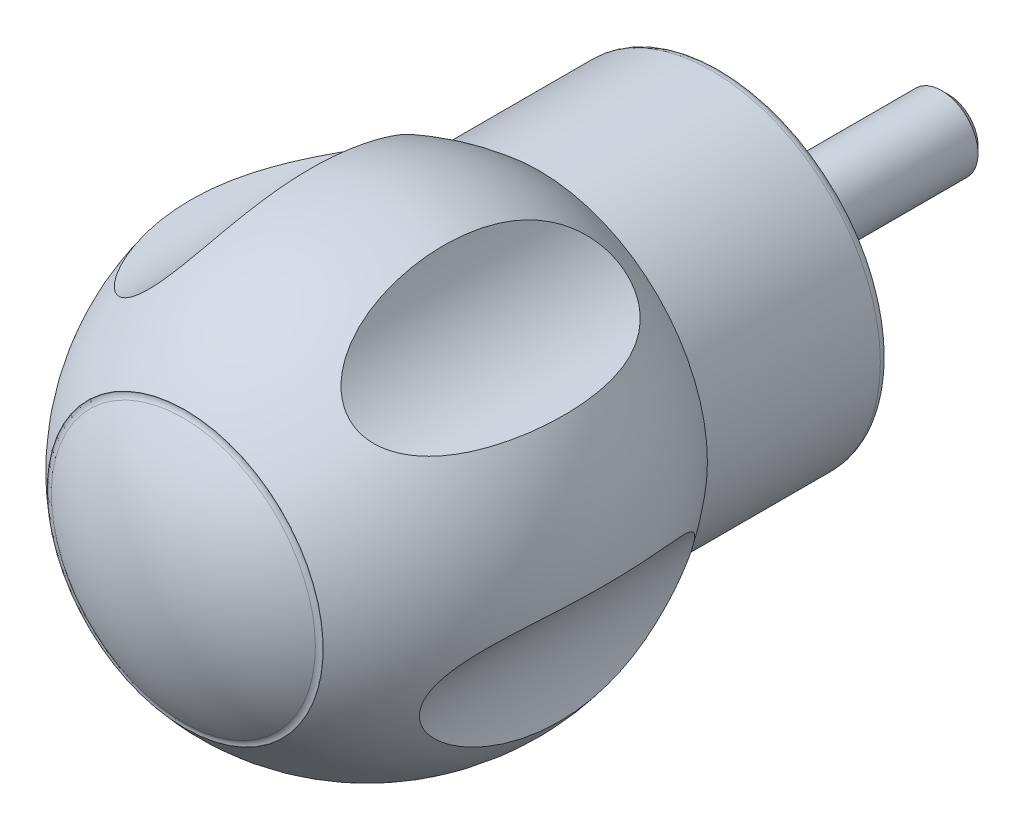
ISO-10303-21;
HEADER;
FILE_DESCRIPTION(('STEP AP214'),'2;1');
FILE_NAME('part.step','',(''),(''),'','','');
FILE_SCHEMA(('AUTOMOTIVE_DESIGN { 1 0 10303 214 1 1 1 1 }'));
ENDSEC;
DATA;
#1=APPLICATION_CONTEXT('core data for automotive mechanical design processes');
#2=APPLICATION_PROTOCOL_DEFINITION('international standard','automotive_design',2000,#1);
#3=PRODUCT_CONTEXT('',#1,'mechanical');
#4=PRODUCT('Part','Part','',(#3));
#5=PRODUCT_RELATED_PRODUCT_CATEGORY('part','',(#4));
#6=PRODUCT_DEFINITION_FORMATION('','',#4);
#7=PRODUCT_DEFINITION_CONTEXT('part definition',#1,'design');
#8=PRODUCT_DEFINITION('design','',#6,#7);
#9=PRODUCT_DEFINITION_SHAPE('','',#8);
#10=(LENGTH_UNIT() NAMED_UNIT(*) SI_UNIT(.MILLI.,.METRE.));
#11=(NAMED_UNIT(*) PLANE_ANGLE_UNIT() SI_UNIT($,.RADIAN.));
#12=(NAMED_UNIT(*) SI_UNIT($,.STERADIAN.) SOLID_ANGLE_UNIT());
#13=UNCERTAINTY_MEASURE_WITH_UNIT(LENGTH_MEASURE(1.E-05),#10,'distance_accuracy_value','');
#14=(GEOMETRIC_REPRESENTATION_CONTEXT(3) GLOBAL_UNCERTAINTY_ASSIGNED_CONTEXT((#13)) GLOBAL_UNIT_ASSIGNED_CONTEXT((#10,
#11,#12)) REPRESENTATION_CONTEXT('',''));
#15=CARTESIAN_POINT('',(0.,0.,0.));
#16=DIRECTION('',(0.,0.,1.));
#17=DIRECTION('',(1.,0.,0.));
#18=AXIS2_PLACEMENT_3D('',#15,#16,#17);
#19=CARTESIAN_POINT('',(0.,0.,0.));
#20=DIRECTION('',(0.,0.,-1.));
#21=DIRECTION('',(0.,1.,0.));
#22=AXIS2_PLACEMENT_3D('',#19,#20,#21);
#23=PLANE('',#22);
#24=CARTESIAN_POINT('',(0.,0.,0.));
#25=DIRECTION('',(0.,0.,-1.));
#26=DIRECTION('',(0.,1.,0.));
#27=AXIS2_PLACEMENT_3D('',#24,#25,#26);
#28=CIRCLE('',#27,4.);
#29=CARTESIAN_POINT('',(0.,4.,0.));
#30=VERTEX_POINT('',#29);
#31=EDGE_CURVE('E8',#30,#30,#28,.T.);
#32=ORIENTED_EDGE('',*,*,#31,.F.);
#33=EDGE_LOOP('',(#32));
#34=FACE_BOUND('',#33,.T.);
#35=CARTESIAN_POINT('',(0.,0.,0.));
#36=DIRECTION('',(0.,0.,-1.));
#37=DIRECTION('',(0.,1.,0.));
#38=AXIS2_PLACEMENT_3D('',#35,#36,#37);
#39=CIRCLE('',#38,17.5);
#40=CARTESIAN_POINT('',(0.,17.5,0.));
#41=VERTEX_POINT('',#40);
#42=EDGE_CURVE('E18',#41,#41,#39,.T.);
#43=ORIENTED_EDGE('',*,*,#42,.T.);
#44=EDGE_LOOP('',(#43));
#45=FACE_BOUND('',#44,.T.);
#46=ADVANCED_FACE('F12',(#34,#45),#23,.T.);
#47=CARTESIAN_POINT('',(0.,0.,0.999999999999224));
#48=DIRECTION('',(0.,0.,-1.));
#49=DIRECTION('',(0.,1.,0.));
#50=AXIS2_PLACEMENT_3D('',#47,#48,#49);
#51=TOROIDAL_SURFACE('',#50,17.5000000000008,0.999999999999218);
#52=CARTESIAN_POINT('',(0.,0.,1.));
#53=DIRECTION('',(0.,0.,-1.));
#54=DIRECTION('',(0.,1.,0.));
#55=AXIS2_PLACEMENT_3D('',#52,#53,#54);
#56=CIRCLE('',#55,18.5);
#57=CARTESIAN_POINT('',(0.,18.5,1.));
#58=VERTEX_POINT('',#57);
#59=EDGE_CURVE('E22',#58,#58,#56,.T.);
#60=ORIENTED_EDGE('',*,*,#59,.T.);
#61=EDGE_LOOP('',(#60));
#62=FACE_BOUND('',#61,.T.);
#63=ORIENTED_EDGE('',*,*,#42,.F.);
#64=EDGE_LOOP('',(#63));
#65=FACE_BOUND('',#64,.T.);
#66=ADVANCED_FACE('F120',(#62,#65),#51,.T.);
#67=CARTESIAN_POINT('',(0.,0.,64.));
#68=DIRECTION('',(0.,0.,-1.));
#69=DIRECTION('',(0.,1.,0.));
#70=AXIS2_PLACEMENT_3D('',#67,#68,#69);
#71=CYLINDRICAL_SURFACE('',#70,18.5);
#72=CARTESIAN_POINT('',(0.,0.,20.));
#73=DIRECTION('',(0.,0.,-1.));
#74=DIRECTION('',(0.,1.,0.));
#75=AXIS2_PLACEMENT_3D('',#72,#73,#74);
#76=CIRCLE('',#75,18.5);
#77=CARTESIAN_POINT('',(0.,18.5,20.));
#78=VERTEX_POINT('',#77);
#79=EDGE_CURVE('E27',#78,#78,#76,.T.);
#80=ORIENTED_EDGE('',*,*,#79,.T.);
#81=EDGE_LOOP('',(#80));
#82=FACE_BOUND('',#81,.T.);
#83=ORIENTED_EDGE('',*,*,#59,.F.);
#84=EDGE_LOOP('',(#83));
#85=FACE_BOUND('',#84,.T.);
#86=ADVANCED_FACE('F106',(#82,#85),#71,.T.);
#87=CARTESIAN_POINT('',(0.,0.,37.7823040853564));
#88=DIRECTION('',(0.,0.,-1.));
#89=DIRECTION('',(0.,1.,0.));
#90=AXIS2_PLACEMENT_3D('',#87,#88,#89);
#91=DEGENERATE_TOROIDAL_SURFACE('',#90,2.45981194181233,27.4867978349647,.F.);
#92=CARTESIAN_POINT('',(9.64615552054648,19.1331819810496,24.1833184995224));
#93=CARTESIAN_POINT('',(9.48345657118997,19.3402419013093,24.3794324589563));
#94=CARTESIAN_POINT('',(9.3348650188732,19.5426746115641,24.5920665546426));
#95=CARTESIAN_POINT('',(9.06234425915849,19.9357170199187,25.0428562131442));
#96=CARTESIAN_POINT('',(8.93845436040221,20.1263075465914,25.2810515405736));
#97=CARTESIAN_POINT('',(8.71118421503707,20.4952338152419,25.7786146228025));
#98=CARTESIAN_POINT('',(8.60794571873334,20.6734797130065,26.0381125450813));
#99=CARTESIAN_POINT('',(8.41968766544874,21.0155888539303,26.5724184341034));
#100=CARTESIAN_POINT('',(8.33466135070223,21.1794574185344,26.8472206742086));
#101=CARTESIAN_POINT('',(8.14928092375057,21.5544472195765,27.5198032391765));
#102=CARTESIAN_POINT('',(8.05609382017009,21.7587365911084,27.9233650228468));
#103=CARTESIAN_POINT('',(7.89274210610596,22.1392008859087,28.7480367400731));
#104=CARTESIAN_POINT('',(7.8225900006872,22.3153605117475,29.1691560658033));
#105=CARTESIAN_POINT('',(7.70040655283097,22.6396177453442,30.023843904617));
#106=CARTESIAN_POINT('',(7.64835011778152,22.787754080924,30.4573942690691));
#107=CARTESIAN_POINT('',(7.5583515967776,23.0566849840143,31.3342431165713));
#108=CARTESIAN_POINT('',(7.52040841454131,23.1774816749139,31.7775408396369));
#109=CARTESIAN_POINT('',(7.46554169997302,23.359526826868,32.5355594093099));
#110=CARTESIAN_POINT('',(7.44573424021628,23.4277178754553,32.8484350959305));
#111=CARTESIAN_POINT('',(7.41078752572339,23.5511669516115,33.4770140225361));
#112=CARTESIAN_POINT('',(7.39564860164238,23.6064240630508,33.7927174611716));
#113=CARTESIAN_POINT('',(7.36943118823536,23.7041033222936,34.4263549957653));
#114=CARTESIAN_POINT('',(7.35835379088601,23.7465220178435,34.744289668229));
#115=CARTESIAN_POINT('',(7.33982062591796,23.8185798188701,35.3817210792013));
#116=CARTESIAN_POINT('',(7.3323652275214,23.8482176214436,35.7012179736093));
#117=CARTESIAN_POINT('',(7.31489793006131,23.9181580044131,36.662895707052));
#118=CARTESIAN_POINT('',(7.30984724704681,23.9392423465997,37.3066647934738));
#119=CARTESIAN_POINT('',(7.31201499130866,23.930357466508,38.5937099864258));
#120=CARTESIAN_POINT('',(7.3192310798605,23.9003979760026,39.2369861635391));
#121=CARTESIAN_POINT('',(7.34031673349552,23.8167327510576,40.2018959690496));
#122=CARTESIAN_POINT('',(7.34913632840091,23.7820772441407,40.5253890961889));
#123=CARTESIAN_POINT('',(7.37065082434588,23.6995982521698,41.1705501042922));
#124=CARTESIAN_POINT('',(7.38334530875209,23.6517761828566,41.4922181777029));
#125=CARTESIAN_POINT('',(7.41313830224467,23.5428498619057,42.1332804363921));
#126=CARTESIAN_POINT('',(7.4302392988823,23.4817381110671,42.4526732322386));
#127=CARTESIAN_POINT('',(7.46953672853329,23.346142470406,43.0882937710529));
#128=CARTESIAN_POINT('',(7.49173305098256,23.2716588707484,43.4045215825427));
#129=CARTESIAN_POINT('',(7.54196498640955,23.1096128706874,44.0313942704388));
#130=CARTESIAN_POINT('',(7.56996980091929,23.0221201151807,44.3420595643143));
#131=CARTESIAN_POINT('',(7.63295092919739,22.8336259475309,44.9585946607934));
#132=CARTESIAN_POINT('',(7.66792784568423,22.7326233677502,45.2644640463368));
#133=CARTESIAN_POINT('',(7.74609493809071,22.5170918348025,45.8699523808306));
#134=CARTESIAN_POINT('',(7.78927572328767,22.4025784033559,46.1695780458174));
#135=CARTESIAN_POINT('',(7.88540878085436,22.1598219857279,46.7615525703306));
#136=CARTESIAN_POINT('',(7.93835812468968,22.0315831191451,47.0539035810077));
#137=CARTESIAN_POINT('',(8.04334062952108,21.7901126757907,47.568273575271));
#138=CARTESIAN_POINT('',(8.09315689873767,21.6795205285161,47.7919850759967));
#139=CARTESIAN_POINT('',(8.2010375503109,21.4497580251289,48.2329104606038));
#140=CARTESIAN_POINT('',(8.25910080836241,21.3305888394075,48.4501252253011));
#141=CARTESIAN_POINT('',(8.3847913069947,21.0834789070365,48.8772303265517));
#142=CARTESIAN_POINT('',(8.45243513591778,20.9555231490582,49.0871071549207));
#143=CARTESIAN_POINT('',(8.59858161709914,20.6911498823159,49.4975980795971));
#144=CARTESIAN_POINT('',(8.67708445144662,20.5547322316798,49.6982120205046));
#145=CARTESIAN_POINT('',(8.84769419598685,20.2716944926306,50.0910311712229));
#146=CARTESIAN_POINT('',(8.93998001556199,20.1249561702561,50.283074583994));
#147=CARTESIAN_POINT('',(9.13905119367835,19.8235620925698,50.6531080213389));
#148=CARTESIAN_POINT('',(9.24584025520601,19.6689043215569,50.831094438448));
#149=CARTESIAN_POINT('',(9.47526528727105,19.3532201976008,51.1690858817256));
#150=CARTESIAN_POINT('',(9.5978411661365,19.1922195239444,51.3291549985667));
#151=CARTESIAN_POINT('',(9.86055062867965,18.8650643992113,51.6279005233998));
#152=CARTESIAN_POINT('',(10.0006666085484,18.698915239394,51.7665980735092));
#153=CARTESIAN_POINT('',(10.3189452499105,18.3420469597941,52.034220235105));
#154=CARTESIAN_POINT('',(10.4996818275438,18.1509018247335,52.1596296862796));
#155=CARTESIAN_POINT('',(10.7882432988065,17.8653559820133,52.3173260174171));
#156=CARTESIAN_POINT('',(10.8873535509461,17.7703573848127,52.3648259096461));
#157=CARTESIAN_POINT('',(11.0911138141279,17.5814933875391,52.4488653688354));
#158=CARTESIAN_POINT('',(11.1957612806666,17.4876274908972,52.4854099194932));
#159=CARTESIAN_POINT('',(11.4109272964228,17.3011546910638,52.547029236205));
#160=CARTESIAN_POINT('',(11.5214842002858,17.2085626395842,52.5720153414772));
#161=CARTESIAN_POINT('',(11.7469624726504,17.0262974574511,52.6095383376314));
#162=CARTESIAN_POINT('',(11.8618819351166,16.9366230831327,52.6220806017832));
#163=CARTESIAN_POINT('',(12.0952129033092,16.7610112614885,52.6344332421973));
#164=CARTESIAN_POINT('',(12.213624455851,16.675073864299,52.6342434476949));
#165=CARTESIAN_POINT('',(12.4528872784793,16.5076976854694,52.6211364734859));
#166=CARTESIAN_POINT('',(12.5737384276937,16.4262586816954,52.6082199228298));
#167=CARTESIAN_POINT('',(12.8055938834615,16.2757414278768,52.5717303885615));
#168=CARTESIAN_POINT('',(12.9164810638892,16.2062153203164,52.5492472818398));
#169=CARTESIAN_POINT('',(13.1385793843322,16.0716588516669,52.4944712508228));
#170=CARTESIAN_POINT('',(13.2497906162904,16.0066299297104,52.4621752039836));
#171=CARTESIAN_POINT('',(13.5827295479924,15.8186232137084,52.3513785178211));
#172=CARTESIAN_POINT('',(13.8038861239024,15.7026457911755,52.2589490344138));
#173=CARTESIAN_POINT('',(14.320248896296,15.450110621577,52.0022092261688));
#174=CARTESIAN_POINT('',(14.6125049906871,15.3218679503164,51.8239538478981));
#175=CARTESIAN_POINT('',(15.1772253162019,15.0968616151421,51.4218619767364));
#176=CARTESIAN_POINT('',(15.4496457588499,15.0001660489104,51.1979285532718));
#177=CARTESIAN_POINT('',(15.9069492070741,14.8535028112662,50.7756127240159));
#178=CARTESIAN_POINT('',(16.0968863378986,14.7978916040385,50.5844859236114));
#179=CARTESIAN_POINT('',(16.4633333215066,14.699129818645,50.1866432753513));
#180=CARTESIAN_POINT('',(16.6398361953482,14.6559856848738,49.9799194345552));
#181=CARTESIAN_POINT('',(16.9795964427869,14.5800076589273,49.5536597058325));
#182=CARTESIAN_POINT('',(17.1428342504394,14.5471887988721,49.3341056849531));
#183=CARTESIAN_POINT('',(17.4561371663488,14.4900636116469,48.8846930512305));
#184=CARTESIAN_POINT('',(17.6061977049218,14.465760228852,48.6548309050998));
#185=CARTESIAN_POINT('',(17.9868742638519,14.4104834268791,48.0345307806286));
#186=CARTESIAN_POINT('',(18.2064910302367,14.3854339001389,47.6367866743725));
#187=CARTESIAN_POINT('',(18.6128643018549,14.3481661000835,46.824233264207));
#188=CARTESIAN_POINT('',(18.7996003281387,14.3359557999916,46.4094135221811));
#189=CARTESIAN_POINT('',(19.1421520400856,14.3198933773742,45.5664949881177));
#190=CARTESIAN_POINT('',(19.2979273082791,14.3160521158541,45.1383796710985));
#191=CARTESIAN_POINT('',(19.5797908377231,14.3133116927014,44.2725635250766));
#192=CARTESIAN_POINT('',(19.7058818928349,14.3144120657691,43.8348636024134));
#193=CARTESIAN_POINT('',(19.8965253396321,14.3182934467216,43.0829226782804));
#194=CARTESIAN_POINT('',(19.9682474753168,14.3204809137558,42.7704677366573));
#195=CARTESIAN_POINT('',(20.0979520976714,14.3253342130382,42.1426951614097));
#196=CARTESIAN_POINT('',(20.1559336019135,14.3280000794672,41.8273773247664));
#197=CARTESIAN_POINT('',(20.2584423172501,14.3332555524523,41.1944730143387));
#198=CARTESIAN_POINT('',(20.3029657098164,14.3358451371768,40.8768859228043));
#199=CARTESIAN_POINT('',(20.3787485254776,14.3405408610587,40.2401174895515));
#200=CARTESIAN_POINT('',(20.4100065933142,14.3426469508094,39.9209359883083));
#201=CARTESIAN_POINT('',(20.4842130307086,14.3477811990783,38.9605812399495));
#202=CARTESIAN_POINT('',(20.5074047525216,14.3496131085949,38.3177751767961));
#203=CARTESIAN_POINT('',(20.5015908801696,14.3491769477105,37.0325236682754));
#204=CARTESIAN_POINT('',(20.4725953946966,14.3469096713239,36.3900781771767));
#205=CARTESIAN_POINT('',(20.3892363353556,14.3412565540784,35.4261568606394));
#206=CARTESIAN_POINT('',(20.3544771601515,14.33897637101,35.1028822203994));
#207=CARTESIAN_POINT('',(20.2712780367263,14.3340068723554,34.4581139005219));
#208=CARTESIAN_POINT('',(20.2228395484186,14.331317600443,34.1366200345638));
#209=CARTESIAN_POINT('',(20.1120162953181,14.3259866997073,33.4958601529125));
#210=CARTESIAN_POINT('',(20.0496237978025,14.3233450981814,33.1765954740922));
#211=CARTESIAN_POINT('',(19.9105983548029,14.3187268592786,32.5411744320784));
#212=CARTESIAN_POINT('',(19.8339657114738,14.3167502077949,32.2250180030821));
#213=CARTESIAN_POINT('',(19.6664947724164,14.3142459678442,31.59816542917));
#214=CARTESIAN_POINT('',(19.5757293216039,14.3137111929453,31.2874499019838));
#215=CARTESIAN_POINT('',(19.3792557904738,14.3150195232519,30.6707388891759));
#216=CARTESIAN_POINT('',(19.2735464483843,14.3168628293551,30.364743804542));
#217=CARTESIAN_POINT('',(19.0467867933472,14.3240841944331,29.7589039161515));
#218=CARTESIAN_POINT('',(18.9257536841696,14.3294583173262,29.4590526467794));
#219=CARTESIAN_POINT('',(18.667680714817,14.3451379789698,28.866510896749));
#220=CARTESIAN_POINT('',(18.5306455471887,14.3554420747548,28.5738183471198));
#221=CARTESIAN_POINT('',(18.2698206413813,14.3798794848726,28.0565192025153));
#222=CARTESIAN_POINT('',(18.1491118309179,14.3927877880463,27.8303006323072));
#223=CARTESIAN_POINT('',(17.8968255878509,14.4237999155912,27.3843837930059));
#224=CARTESIAN_POINT('',(17.7652496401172,14.4419030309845,27.1646846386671));
#225=CARTESIAN_POINT('',(17.4906228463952,14.4845139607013,26.7326331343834));
#226=CARTESIAN_POINT('',(17.3475519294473,14.5090331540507,26.5202946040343));
#227=CARTESIAN_POINT('',(17.0498212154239,14.5658261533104,26.1049313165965));
#228=CARTESIAN_POINT('',(16.8951612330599,14.5981000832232,25.9019067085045));
#229=CARTESIAN_POINT('',(16.5716975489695,14.6725075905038,25.5042749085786));
#230=CARTESIAN_POINT('',(16.4027212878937,14.7147773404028,25.3098324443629));
#231=CARTESIAN_POINT('',(16.0525323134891,14.8107759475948,24.9351177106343));
#232=CARTESIAN_POINT('',(15.8713163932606,14.8645078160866,24.7548491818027));
#233=CARTESIAN_POINT('',(15.4977153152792,14.9852344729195,24.4124922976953));
#234=CARTESIAN_POINT('',(15.3053750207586,15.0521783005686,24.2503377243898));
#235=CARTESIAN_POINT('',(14.9101396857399,15.2013886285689,23.9476798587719));
#236=CARTESIAN_POINT('',(14.7072556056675,15.2836394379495,23.8071546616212));
#237=CARTESIAN_POINT('',(14.2677894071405,15.4762585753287,23.5371657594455));
#238=CARTESIAN_POINT('',(14.0300690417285,15.5888074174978,23.4110046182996));
#239=CARTESIAN_POINT('',(13.6691228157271,15.7746252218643,23.2521491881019));
#240=CARTESIAN_POINT('',(13.5480644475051,15.839406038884,23.204257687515));
#241=CARTESIAN_POINT('',(13.3052834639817,15.9746013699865,23.1194301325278));
#242=CARTESIAN_POINT('',(13.1835611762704,16.0450133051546,23.0824890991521));
#243=CARTESIAN_POINT('',(12.9394612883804,16.1918335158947,23.0200747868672));
#244=CARTESIAN_POINT('',(12.8170857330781,16.2682832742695,22.9946907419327));
#245=CARTESIAN_POINT('',(12.5737336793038,16.4262595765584,22.9563831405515));
#246=CARTESIAN_POINT('',(12.4527565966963,16.5077839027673,22.9434541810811));
#247=CARTESIAN_POINT('',(12.2132400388,16.6753479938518,22.9303540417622));
#248=CARTESIAN_POINT('',(12.0947006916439,16.761387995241,22.9301835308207));
#249=CARTESIAN_POINT('',(11.8611503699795,16.937182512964,22.9425849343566));
#250=CARTESIAN_POINT('',(11.7461391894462,17.026936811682,22.955156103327));
#251=CARTESIAN_POINT('',(11.4286566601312,17.2836473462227,23.0081332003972));
#252=CARTESIAN_POINT('',(11.2311540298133,17.4540059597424,23.0628637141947));
#253=CARTESIAN_POINT('',(10.8547688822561,17.798819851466,23.2095558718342));
#254=CARTESIAN_POINT('',(10.6758911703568,17.9732761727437,23.3015270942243));
#255=CARTESIAN_POINT('',(10.3454340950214,18.3141897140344,23.5125503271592));
#256=CARTESIAN_POINT('',(10.1930118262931,18.4806684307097,23.6302683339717));
#257=CARTESIAN_POINT('',(9.9063000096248,18.8100812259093,23.8898050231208));
#258=CARTESIAN_POINT('',(9.77200724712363,18.9730159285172,24.0316194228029));
#259=CARTESIAN_POINT('',(9.64615552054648,19.1331819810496,24.1833184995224));
#260=B_SPLINE_CURVE_WITH_KNOTS('',3,(#92,#93,#94,#95,#96,#97,#98,#99,#100,#101,#102,#103,#104,
#105,#106,#107,#108,#109,#110,#111,#112,#113,#114,#115,#116,#117,#118,#119,#120,#121,#122,#123,
#124,#125,#126,#127,#128,#129,#130,#131,#132,#133,#134,#135,#136,#137,#138,#139,#140,#141,#142,
#143,#144,#145,#146,#147,#148,#149,#150,#151,#152,#153,#154,#155,#156,#157,#158,#159,#160,#161,
#162,#163,#164,#165,#166,#167,#168,#169,#170,#171,#172,#173,#174,#175,#176,#177,#178,#179,#180,
#181,#182,#183,#184,#185,#186,#187,#188,#189,#190,#191,#192,#193,#194,#195,#196,#197,#198,#199,
#200,#201,#202,#203,#204,#205,#206,#207,#208,#209,#210,#211,#212,#213,#214,#215,#216,#217,#218,
#219,#220,#221,#222,#223,#224,#225,#226,#227,#228,#229,#230,#231,#232,#233,#234,#235,#236,#237,
#238,#239,#240,#241,#242,#243,#244,#245,#246,#247,#248,#249,#250,#251,#252,#253,#254,#255,#256,
#257,#258,#259),.UNSPECIFIED.,.T.,.F.,(4,2,2,2,2,2,2,2,2,2,2,2,2,2,2,2,2,2,2,2,2,2,2,2,2,2,2,2,
2,2,2,2,2,2,2,2,2,2,2,2,2,2,2,2,2,2,2,2,2,2,2,2,2,2,2,2,2,2,2,2,2,2,2,2,2,2,2,2,2,2,2,2,2,2,2,2,
2,2,2,2,2,2,2,4),(0.,0.984470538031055,1.97049541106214,2.96307211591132,3.95527987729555,
5.33855218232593,6.72257419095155,8.10466929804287,9.4866570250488,10.4488665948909,
11.4111442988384,12.3736805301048,13.3363148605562,15.2664246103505,17.1961664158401,
18.1723123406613,19.1483533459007,20.1249465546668,21.1015185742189,22.07303913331,
23.0446437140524,24.0151427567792,24.9853513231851,25.7484674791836,26.5114796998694,
27.2758295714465,28.0401922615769,28.8155138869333,29.5910338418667,30.3636845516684,
31.1355659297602,32.0061083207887,32.4414898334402,32.8766729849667,33.3151410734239,
33.7534197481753,34.1917043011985,34.6299671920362,35.0279045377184,35.4259686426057,
36.2216565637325,37.3123882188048,38.4054589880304,39.22976871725,40.0545037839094,
40.8804340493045,41.7066496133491,43.0696147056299,44.4334257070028,45.7990055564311,
47.1644568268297,48.1259320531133,49.0874760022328,50.0492925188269,51.0112072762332,
52.9386033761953,54.8656261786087,55.8408202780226,56.815910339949,57.7915421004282,
58.7671531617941,59.7378926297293,60.7087141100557,61.678455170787,62.6479125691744,
63.417790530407,64.1875634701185,64.9587109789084,65.7298708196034,66.5122118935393,
67.2947587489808,68.0743441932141,68.8531348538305,69.7245362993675,70.1603455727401,
70.5959563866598,71.0348758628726,71.4736048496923,71.9123568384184,72.3510831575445,
73.1467362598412,73.9425941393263,74.7042420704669,75.4657547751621),.UNSPECIFIED.);
#261=CARTESIAN_POINT('',(9.64615552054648,19.1331819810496,24.1833184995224));
#262=VERTEX_POINT('',#261);
#263=EDGE_CURVE('E83',#262,#262,#260,.T.);
#264=ORIENTED_EDGE('',*,*,#263,.F.);
#265=EDGE_LOOP('',(#264));
#266=FACE_BOUND('',#265,.T.);
#267=CARTESIAN_POINT('',(19.0721852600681,-11.1680952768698,25.4426161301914));
#268=CARTESIAN_POINT('',(19.0623640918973,-11.0283355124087,25.2851801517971));
#269=CARTESIAN_POINT('',(19.0545384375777,-10.8837357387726,25.1318868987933));
#270=CARTESIAN_POINT('',(19.0438547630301,-10.5846503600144,24.8351316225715));
#271=CARTESIAN_POINT('',(19.0409972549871,-10.4301637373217,24.691670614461));
#272=CARTESIAN_POINT('',(19.0415090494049,-9.95209015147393,24.2791378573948));
#273=CARTESIAN_POINT('',(19.0538954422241,-9.61310588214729,24.0270115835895));
#274=CARTESIAN_POINT('',(19.1041865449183,-8.99900634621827,23.6497700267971));
#275=CARTESIAN_POINT('',(19.1338737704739,-8.73297996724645,23.5089050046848));
#276=CARTESIAN_POINT('',(19.1938752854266,-8.32262867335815,23.3287295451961));
#277=CARTESIAN_POINT('',(19.2164603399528,-8.18393056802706,23.2738501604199));
#278=CARTESIAN_POINT('',(19.267080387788,-7.90355872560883,23.1754616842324));
#279=CARTESIAN_POINT('',(19.2951129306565,-7.76188635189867,23.1319475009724));
#280=CARTESIAN_POINT('',(19.357082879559,-7.47527231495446,23.0568566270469));
#281=CARTESIAN_POINT('',(19.3910701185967,-7.33031284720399,23.0253884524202));
#282=CARTESIAN_POINT('',(19.4647864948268,-7.03957276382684,22.9756795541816));
#283=CARTESIAN_POINT('',(19.5045155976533,-6.89379215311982,22.9574387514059));
#284=CARTESIAN_POINT('',(19.5895057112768,-6.60284514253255,22.9346551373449));
#285=CARTESIAN_POINT('',(19.6347640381,-6.45767847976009,22.9301057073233));
#286=CARTESIAN_POINT('',(19.7304375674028,-6.16929121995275,22.9348062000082));
#287=CARTESIAN_POINT('',(19.780852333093,-6.02607045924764,22.9440549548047));
#288=CARTESIAN_POINT('',(19.8798541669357,-5.76014382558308,22.9741532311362));
#289=CARTESIAN_POINT('',(19.9279160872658,-5.63706374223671,22.9934527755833));
#290=CARTESIAN_POINT('',(20.0271323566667,-5.39416709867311,23.0421227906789));
#291=CARTESIAN_POINT('',(20.0782876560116,-5.27435155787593,23.0714963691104));
#292=CARTESIAN_POINT('',(20.2356369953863,-4.92085237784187,23.1739727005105));
#293=CARTESIAN_POINT('',(20.3457684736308,-4.6929725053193,23.2614481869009));
#294=CARTESIAN_POINT('',(20.6101862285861,-4.18352994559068,23.5040625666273));
#295=CARTESIAN_POINT('',(20.7669386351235,-3.90944430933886,23.6720412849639));
#296=CARTESIAN_POINT('',(21.0837421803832,-3.39692062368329,24.0533196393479));
#297=CARTESIAN_POINT('',(21.2437993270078,-3.15855548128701,24.266709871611));
#298=CARTESIAN_POINT('',(21.5210545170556,-2.77180192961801,24.6689738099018));
#299=CARTESIAN_POINT('',(21.6388543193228,-2.61590410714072,24.8503989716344));
#300=CARTESIAN_POINT('',(21.8714595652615,-2.32137372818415,25.2286598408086));
#301=CARTESIAN_POINT('',(21.9862634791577,-2.18274986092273,25.4255032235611));
#302=CARTESIAN_POINT('',(22.2117703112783,-1.92107852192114,25.8319054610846));
#303=CARTESIAN_POINT('',(22.3224670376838,-1.79805394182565,26.0414823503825));
#304=CARTESIAN_POINT('',(22.538766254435,-1.5662031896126,26.4709068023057));
#305=CARTESIAN_POINT('',(22.6443669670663,-1.45738195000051,26.6907578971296));
#306=CARTESIAN_POINT('',(22.9164150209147,-1.18608106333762,27.2841896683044));
#307=CARTESIAN_POINT('',(23.0779389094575,-1.03453662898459,27.6650536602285));
#308=CARTESIAN_POINT('',(23.3834716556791,-0.76045920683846,28.4439005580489));
#309=CARTESIAN_POINT('',(23.5274695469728,-0.637944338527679,28.8418939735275));
#310=CARTESIAN_POINT('',(23.7968925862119,-0.417328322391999,29.6513113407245));
#311=CARTESIAN_POINT('',(23.9222912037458,-0.31926191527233,30.0627534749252));
#312=CARTESIAN_POINT('',(24.1534746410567,-0.144173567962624,30.8954130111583));
#313=CARTESIAN_POINT('',(24.2592612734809,-0.0671496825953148,31.3166295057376));
#314=CARTESIAN_POINT('',(24.4238467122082,0.0496019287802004,32.047227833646));
#315=CARTESIAN_POINT('',(24.4875023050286,0.0937309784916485,32.3548380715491));
#316=CARTESIAN_POINT('',(24.6042630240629,0.173368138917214,32.973190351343));
#317=CARTESIAN_POINT('',(24.6573673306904,0.208875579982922,33.2839326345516));
#318=CARTESIAN_POINT('',(24.7529207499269,0.271939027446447,33.9079408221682));
#319=CARTESIAN_POINT('',(24.7953666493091,0.29949263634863,34.2212074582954));
#320=CARTESIAN_POINT('',(24.8695059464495,0.347151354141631,34.849603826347));
#321=CARTESIAN_POINT('',(24.9011982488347,0.367255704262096,35.1647337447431));
#322=CARTESIAN_POINT('',(24.9538094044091,0.4004149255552,35.7967783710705));
#323=CARTESIAN_POINT('',(24.9747105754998,0.41345822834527,36.1136951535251));
#324=CARTESIAN_POINT('',(25.0056258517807,0.432690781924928,36.7482953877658));
#325=CARTESIAN_POINT('',(25.0156389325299,0.438879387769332,37.0659789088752));
#326=CARTESIAN_POINT('',(25.0247561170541,0.444515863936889,37.701486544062));
#327=CARTESIAN_POINT('',(25.0238628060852,0.443965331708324,38.0193106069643));
#328=CARTESIAN_POINT('',(25.0111750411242,0.436117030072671,38.6546576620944));
#329=CARTESIAN_POINT('',(24.9993805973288,0.4288192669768,38.9721806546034));
#330=CARTESIAN_POINT('',(24.9646664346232,0.407187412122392,39.6109021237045));
#331=CARTESIAN_POINT('',(24.9415913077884,0.392754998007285,39.9320888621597));
#332=CARTESIAN_POINT('',(24.8842948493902,0.35653347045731,40.5730139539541));
#333=CARTESIAN_POINT('',(24.8500748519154,0.334745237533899,40.8927524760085));
#334=CARTESIAN_POINT('',(24.770531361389,0.28337778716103,41.5303953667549));
#335=CARTESIAN_POINT('',(24.7252019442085,0.253794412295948,41.8482986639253));
#336=CARTESIAN_POINT('',(24.6235459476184,0.186275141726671,42.4814152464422));
#337=CARTESIAN_POINT('',(24.5672207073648,0.148340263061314,42.7966288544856));
#338=CARTESIAN_POINT('',(24.4439137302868,0.0635358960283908,43.4225619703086));
#339=CARTESIAN_POINT('',(24.3769710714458,0.0166990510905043,43.7332935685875));
#340=CARTESIAN_POINT('',(24.2324546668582,-0.0868896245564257,44.3505654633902));
#341=CARTESIAN_POINT('',(24.154882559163,-0.143639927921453,44.657106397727));
#342=CARTESIAN_POINT('',(23.9893767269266,-0.268104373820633,45.264857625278));
#343=CARTESIAN_POINT('',(23.9014515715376,-0.335809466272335,45.5660720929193));
#344=CARTESIAN_POINT('',(23.7154832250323,-0.483512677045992,46.1622480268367));
#345=CARTESIAN_POINT('',(23.6174424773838,-0.563507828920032,46.45721098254));
#346=CARTESIAN_POINT('',(23.4257259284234,-0.725434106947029,46.9996108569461));
#347=CARTESIAN_POINT('',(23.3332965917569,-0.80559397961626,47.248016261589));
#348=CARTESIAN_POINT('',(23.1414992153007,-0.977402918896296,47.738084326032));
#349=CARTESIAN_POINT('',(23.042131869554,-1.0690508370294,47.9797476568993));
#350=CARTESIAN_POINT('',(22.836865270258,-1.2651914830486,48.4550245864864));
#351=CARTESIAN_POINT('',(22.7309652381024,-1.36968574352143,48.6886372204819));
#352=CARTESIAN_POINT('',(22.5132257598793,-1.5930227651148,49.1460594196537));
#353=CARTESIAN_POINT('',(22.4013870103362,-1.71186384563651,49.3698701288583));
#354=CARTESIAN_POINT('',(22.1901963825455,-1.94603320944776,49.771941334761));
#355=CARTESIAN_POINT('',(22.0915743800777,-2.05908329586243,49.9519081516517));
#356=CARTESIAN_POINT('',(21.8912959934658,-2.29775849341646,50.3016081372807));
#357=CARTESIAN_POINT('',(21.7896393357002,-2.42338474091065,50.4713403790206));
#358=CARTESIAN_POINT('',(21.5843567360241,-2.68806499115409,50.7981776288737));
#359=CARTESIAN_POINT('',(21.4807348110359,-2.82709356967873,50.9553055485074));
#360=CARTESIAN_POINT('',(21.2725598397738,-3.11965882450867,51.2546655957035));
#361=CARTESIAN_POINT('',(21.1680069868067,-3.27319254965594,51.3969007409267));
#362=CARTESIAN_POINT('',(20.9242857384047,-3.64993770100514,51.7083703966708));
#363=CARTESIAN_POINT('',(20.7852831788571,-3.87923401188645,51.8706322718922));
#364=CARTESIAN_POINT('',(20.581320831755,-4.24337798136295,52.08338385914));
#365=CARTESIAN_POINT('',(20.5140777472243,-4.36815194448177,52.1492039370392));
#366=CARTESIAN_POINT('',(20.3818256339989,-4.62414700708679,52.2695153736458));
#367=CARTESIAN_POINT('',(20.3168154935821,-4.75536481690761,52.3240124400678));
#368=CARTESIAN_POINT('',(20.1891131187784,-5.02518084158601,52.4211148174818));
#369=CARTESIAN_POINT('',(20.1264539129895,-5.1638439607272,52.4635838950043));
#370=CARTESIAN_POINT('',(20.0050835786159,-5.44625718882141,52.5348095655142));
#371=CARTESIAN_POINT('',(19.9463703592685,-5.5900045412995,52.5635734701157));
#372=CARTESIAN_POINT('',(19.8336837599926,-5.88139098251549,52.6066569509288));
#373=CARTESIAN_POINT('',(19.779707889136,-6.02902797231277,52.6209841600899));
#374=CARTESIAN_POINT('',(19.6771442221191,-6.32683662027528,52.6348208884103));
#375=CARTESIAN_POINT('',(19.6285557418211,-6.47700795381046,52.6343322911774));
#376=CARTESIAN_POINT('',(19.5436532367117,-6.75723229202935,52.6196633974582));
#377=CARTESIAN_POINT('',(19.5065731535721,-6.88715799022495,52.607409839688));
#378=CARTESIAN_POINT('',(19.4369248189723,-7.14678746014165,52.5722284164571));
#379=CARTESIAN_POINT('',(19.4043578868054,-7.27649115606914,52.5492974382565));
#380=CARTESIAN_POINT('',(19.3135579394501,-7.66382691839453,52.4651006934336));
#381=CARTESIAN_POINT('',(19.2621768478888,-7.91984661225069,52.3884218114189));
#382=CARTESIAN_POINT('',(19.1660350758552,-8.48522658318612,52.1749375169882));
#383=CARTESIAN_POINT('',(19.1263358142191,-8.79146523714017,52.027765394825));
#384=CARTESIAN_POINT('',(19.0700867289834,-9.38041135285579,51.6886082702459));
#385=CARTESIAN_POINT('',(19.0535777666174,-9.66307645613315,51.4965448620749));
#386=CARTESIAN_POINT('',(19.0405665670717,-10.1295722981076,51.1346277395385));
#387=CARTESIAN_POINT('',(19.0398828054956,-10.3195626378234,50.9726561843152));
#388=CARTESIAN_POINT('',(19.0462252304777,-10.6856064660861,50.6336861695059));
#389=CARTESIAN_POINT('',(19.0532550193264,-10.8616534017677,50.4566807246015));
#390=CARTESIAN_POINT('',(19.0733427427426,-11.2002791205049,50.0901686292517));
#391=CARTESIAN_POINT('',(19.0864092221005,-11.3628384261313,49.9006445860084));
#392=CARTESIAN_POINT('',(19.117108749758,-11.6748367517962,49.5114023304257));
#393=CARTESIAN_POINT('',(19.1347433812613,-11.8242711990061,49.3116806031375));
#394=CARTESIAN_POINT('',(19.1856441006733,-12.202226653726,48.7733353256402));
#395=CARTESIAN_POINT('',(19.2216949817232,-12.4202162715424,48.4275565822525));
#396=CARTESIAN_POINT('',(19.2981940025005,-12.825499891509,47.7188879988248));
#397=CARTESIAN_POINT('',(19.3386448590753,-13.0127747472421,47.3559876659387));
#398=CARTESIAN_POINT('',(19.4206221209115,-13.35943497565,46.6165314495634));
#399=CARTESIAN_POINT('',(19.4621502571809,-13.5187718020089,46.2399531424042));
#400=CARTESIAN_POINT('',(19.5435868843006,-13.8113796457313,45.4767269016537));
#401=CARTESIAN_POINT('',(19.5834955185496,-13.9446529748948,45.0900798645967));
#402=CARTESIAN_POINT('',(19.6501579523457,-14.1566882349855,44.4066290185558));
#403=CARTESIAN_POINT('',(19.6777064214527,-14.2407488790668,44.1115260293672));
#404=CARTESIAN_POINT('',(19.7300953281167,-14.3958988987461,43.5176637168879));
#405=CARTESIAN_POINT('',(19.7549355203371,-14.4669870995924,43.2189040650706));
#406=CARTESIAN_POINT('',(19.8013565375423,-14.5967402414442,42.6183481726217));
#407=CARTESIAN_POINT('',(19.8229362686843,-14.6554010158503,42.3165509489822));
#408=CARTESIAN_POINT('',(19.8623907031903,-14.7607054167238,41.7106150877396));
#409=CARTESIAN_POINT('',(19.8802650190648,-14.8073477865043,41.4064762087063));
#410=CARTESIAN_POINT('',(19.9277972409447,-14.9298115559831,40.4911627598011));
#411=CARTESIAN_POINT('',(19.9513523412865,-14.9881373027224,39.877243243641));
#412=CARTESIAN_POINT('',(19.980434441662,-15.0598279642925,38.6464982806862));
#413=CARTESIAN_POINT('',(19.98596455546,-15.0732006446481,38.0296733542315));
#414=CARTESIAN_POINT('',(19.9804674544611,-15.059744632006,37.0990523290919));
#415=CARTESIAN_POINT('',(19.9762262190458,-15.0494054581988,36.7848898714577));
#416=CARTESIAN_POINT('',(19.9630675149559,-15.0170456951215,36.1572728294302));
#417=CARTESIAN_POINT('',(19.9541504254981,-14.9950260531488,35.8438181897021));
#418=CARTESIAN_POINT('',(19.9317957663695,-14.9391344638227,35.2180253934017));
#419=CARTESIAN_POINT('',(19.9183566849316,-14.9052585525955,34.9056876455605));
#420=CARTESIAN_POINT('',(19.8872163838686,-14.8254014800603,34.2828052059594));
#421=CARTESIAN_POINT('',(19.8695156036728,-14.7794215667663,33.9722603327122));
#422=CARTESIAN_POINT('',(19.8301819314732,-14.6749485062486,33.3531945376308));
#423=CARTESIAN_POINT('',(19.8085449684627,-14.6164423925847,33.0446760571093));
#424=CARTESIAN_POINT('',(19.7618132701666,-14.4864993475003,32.4306708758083));
#425=CARTESIAN_POINT('',(19.7367189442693,-14.4150639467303,32.1251838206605));
#426=CARTESIAN_POINT('',(19.6836570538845,-14.2587267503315,31.5180455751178));
#427=CARTESIAN_POINT('',(19.6556906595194,-14.1738304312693,31.2163928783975));
#428=CARTESIAN_POINT('',(19.5975967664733,-13.9898887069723,30.6176812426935));
#429=CARTESIAN_POINT('',(19.5674694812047,-13.8908446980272,30.3206218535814));
#430=CARTESIAN_POINT('',(19.4931147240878,-13.633529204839,29.6097093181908));
#431=CARTESIAN_POINT('',(19.4482286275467,-13.4677451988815,29.1985987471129));
#432=CARTESIAN_POINT('',(19.3589486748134,-13.1034501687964,28.3908356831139));
#433=CARTESIAN_POINT('',(19.3145550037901,-12.9049272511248,27.9941885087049));
#434=CARTESIAN_POINT('',(19.2306273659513,-12.4728645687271,27.2220747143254));
#435=CARTESIAN_POINT('',(19.1910708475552,-12.2394995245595,26.8465145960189));
#436=CARTESIAN_POINT('',(19.1394074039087,-11.8602414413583,26.3032059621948));
#437=CARTESIAN_POINT('',(19.1234698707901,-11.7290145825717,26.1255117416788));
#438=CARTESIAN_POINT('',(19.0950168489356,-11.4563347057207,25.7778951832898));
#439=CARTESIAN_POINT('',(19.0825004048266,-11.3148845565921,25.6079706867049));
#440=CARTESIAN_POINT('',(19.0721852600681,-11.1680952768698,25.4426161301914));
#441=B_SPLINE_CURVE_WITH_KNOTS('',3,(#267,#268,#269,#270,#271,#272,#273,#274,#275,#276,#277,
#278,#279,#280,#281,#282,#283,#284,#285,#286,#287,#288,#289,#290,#291,#292,#293,#294,#295,#296,
#297,#298,#299,#300,#301,#302,#303,#304,#305,#306,#307,#308,#309,#310,#311,#312,#313,#314,#315,
#316,#317,#318,#319,#320,#321,#322,#323,#324,#325,#326,#327,#328,#329,#330,#331,#332,#333,#334,
#335,#336,#337,#338,#339,#340,#341,#342,#343,#344,#345,#346,#347,#348,#349,#350,#351,#352,#353,
#354,#355,#356,#357,#358,#359,#360,#361,#362,#363,#364,#365,#366,#367,#368,#369,#370,#371,#372,
#373,#374,#375,#376,#377,#378,#379,#380,#381,#382,#383,#384,#385,#386,#387,#388,#389,#390,#391,
#392,#393,#394,#395,#396,#397,#398,#399,#400,#401,#402,#403,#404,#405,#406,#407,#408,#409,#410,
#411,#412,#413,#414,#415,#416,#417,#418,#419,#420,#421,#422,#423,#424,#425,#426,#427,#428,#429,
#430,#431,#432,#433,#434,#435,#436,#437,#438,#439,#440),.UNSPECIFIED.,.T.,.F.,(4,2,2,2,2,2,2,2,
2,2,2,2,2,2,2,2,2,2,2,2,2,2,2,2,2,2,2,2,2,2,2,2,2,2,2,2,2,2,2,2,2,2,2,2,2,2,2,2,2,2,2,2,2,2,2,2,
2,2,2,2,2,2,2,2,2,2,2,2,2,2,2,2,2,2,2,2,2,2,2,2,2,2,2,2,2,2,4),(0.,0.632111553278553,
1.26428826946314,2.52507796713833,3.42891741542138,3.88101915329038,4.33291799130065,
4.78879696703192,5.24467321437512,5.70032904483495,6.15594630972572,6.55607609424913,
6.95632942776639,7.75637833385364,8.82352779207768,9.89282651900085,10.6916909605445,
11.4909556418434,12.2913799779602,13.0920815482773,14.4117420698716,15.732224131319,
17.0545720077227,18.3767976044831,19.3281410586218,20.2795583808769,21.2312621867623,
22.183062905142,23.1364183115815,24.0898634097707,25.0430825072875,25.9963007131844,
26.9630375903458,27.9296587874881,28.8967965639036,29.8638166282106,30.8273567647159,
31.7907485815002,32.7533485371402,33.7157165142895,34.5460547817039,35.3763101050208,
36.2066645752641,37.0369218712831,37.7393011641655,38.4417439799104,39.1428795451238,
39.8438727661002,40.7802631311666,41.2486393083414,41.7167788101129,42.1900259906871,
42.6630204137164,43.1357646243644,43.6084487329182,44.0149459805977,44.4215618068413,
45.2342888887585,46.2550563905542,47.2776202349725,48.0256360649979,48.7740013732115,
49.5234292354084,50.2731171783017,51.5021937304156,52.732033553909,53.9639896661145,
55.1958364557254,56.1197669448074,57.0437810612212,57.9681044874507,58.8925245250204,
60.741830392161,62.5908167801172,63.5336888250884,64.4764844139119,65.4195955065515,
66.3626093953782,67.3066042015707,68.2504873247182,69.1939874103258,70.1373944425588,
71.4726853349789,72.8084623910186,74.1377530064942,74.8018436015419,75.4657485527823),.UNSPECIFIED.);
#442=CARTESIAN_POINT('',(19.0721852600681,-11.1680952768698,25.4426161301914));
#443=VERTEX_POINT('',#442);
#444=EDGE_CURVE('E78',#443,#443,#441,.T.);
#445=ORIENTED_EDGE('',*,*,#444,.F.);
#446=EDGE_LOOP('',(#445));
#447=FACE_BOUND('',#446,.T.);
#448=CARTESIAN_POINT('',(-4.39828338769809,-21.4619120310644,25.0647607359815));
#449=CARTESIAN_POINT('',(-4.14449352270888,-21.367454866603,24.7898352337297));
#450=CARTESIAN_POINT('',(-3.87234979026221,-21.2754235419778,24.5306716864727));
#451=CARTESIAN_POINT('',(-3.28916050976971,-21.1027408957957,24.0558665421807));
#452=CARTESIAN_POINT('',(-2.97817789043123,-21.022071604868,23.8401559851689));
#453=CARTESIAN_POINT('',(-2.39618792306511,-20.8970859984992,23.511441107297));
#454=CARTESIAN_POINT('',(-2.13308420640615,-20.8486836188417,23.3862121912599));
#455=CARTESIAN_POINT('',(-1.72478466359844,-20.7877529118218,23.2299049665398));
#456=CARTESIAN_POINT('',(-1.58639019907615,-20.7693863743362,23.1830541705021));
#457=CARTESIAN_POINT('',(-1.30578935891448,-20.7369971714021,23.1007222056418));
#458=CARTESIAN_POINT('',(-1.16358469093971,-20.7229725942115,23.0652360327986));
#459=CARTESIAN_POINT('',(-0.875236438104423,-20.6995730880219,23.0061634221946));
#460=CARTESIAN_POINT('',(-0.72907151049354,-20.6902332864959,22.9826668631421));
#461=CARTESIAN_POINT('',(-0.435003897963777,-20.6766460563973,22.9485202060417));
#462=CARTESIAN_POINT('',(-0.287101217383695,-20.672398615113,22.937870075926));
#463=CARTESIAN_POINT('',(0.00909543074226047,-20.6691336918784,22.9296815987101));
#464=CARTESIAN_POINT('',(0.157389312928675,-20.6701151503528,22.9321405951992));
#465=CARTESIAN_POINT('',(0.453048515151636,-20.6772736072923,22.9501025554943));
#466=CARTESIAN_POINT('',(0.600413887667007,-20.6834503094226,22.9656047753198));
#467=CARTESIAN_POINT('',(0.877539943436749,-20.6998880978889,23.006973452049));
#468=CARTESIAN_POINT('',(1.0075211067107,-20.709650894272,23.0315773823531));
#469=CARTESIAN_POINT('',(1.26494567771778,-20.732938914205,23.0904648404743));
#470=CARTESIAN_POINT('',(1.39238828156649,-20.7464653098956,23.1247513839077));
#471=CARTESIAN_POINT('',(1.76979609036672,-20.7922458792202,23.241284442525));
#472=CARTESIAN_POINT('',(2.01499230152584,-20.8297109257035,23.3372278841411));
#473=CARTESIAN_POINT('',(2.58178370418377,-20.9325649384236,23.6040279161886));
#474=CARTESIAN_POINT('',(2.89547736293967,-21.0031408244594,23.789506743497));
#475=CARTESIAN_POINT('',(3.48720697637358,-21.1578890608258,24.2062262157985));
#476=CARTESIAN_POINT('',(3.76516235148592,-21.2420912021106,24.4375673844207));
#477=CARTESIAN_POINT('',(4.22311572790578,-21.3963650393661,24.874007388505));
#478=CARTESIAN_POINT('',(4.4105712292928,-21.4649470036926,25.0719791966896));
#479=CARTESIAN_POINT('',(4.76670581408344,-21.6040763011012,25.4836324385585));
#480=CARTESIAN_POINT('',(4.93537497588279,-21.6746246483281,25.6973220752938));
#481=CARTESIAN_POINT('',(5.25545315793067,-21.8160142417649,26.137580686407));
#482=CARTESIAN_POINT('',(5.40683664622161,-21.8868557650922,26.3641679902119));
#483=CARTESIAN_POINT('',(5.6935353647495,-22.0273909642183,26.8276693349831));
#484=CARTESIAN_POINT('',(5.82884504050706,-22.0970842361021,27.0645869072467));
#485=CARTESIAN_POINT('',(6.16785540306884,-22.2787627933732,27.7035859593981));
#486=CARTESIAN_POINT('',(6.35887773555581,-22.3888085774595,28.112973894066));
#487=CARTESIAN_POINT('',(6.70604465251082,-22.5990750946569,28.9487545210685));
#488=CARTESIAN_POINT('',(6.86216759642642,-22.6992897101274,29.3751575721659));
#489=CARTESIAN_POINT('',(7.14382984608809,-22.8873835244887,30.2411132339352));
#490=CARTESIAN_POINT('',(7.26933185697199,-22.9752476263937,30.6806811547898));
#491=CARTESIAN_POINT('',(7.49283403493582,-23.1366018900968,31.5692511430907));
#492=CARTESIAN_POINT('',(7.59083682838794,-23.2100934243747,32.0182523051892));
#493=CARTESIAN_POINT('',(7.73565724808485,-23.3212237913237,32.7843988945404));
#494=CARTESIAN_POINT('',(7.78895529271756,-23.3629462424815,33.0997580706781));
#495=CARTESIAN_POINT('',(7.88421240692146,-23.4385058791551,33.7331510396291));
#496=CARTESIAN_POINT('',(7.92617071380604,-23.4723425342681,34.0511850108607));
#497=CARTESIAN_POINT('',(7.99926654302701,-23.5318693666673,34.6893333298));
#498=CARTESIAN_POINT('',(8.03040111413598,-23.5575573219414,35.0094482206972));
#499=CARTESIAN_POINT('',(8.08221460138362,-23.6005867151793,35.6511128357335));
#500=CARTESIAN_POINT('',(8.10289245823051,-23.6179273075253,35.9726627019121));
#501=CARTESIAN_POINT('',(8.13407357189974,-23.6441625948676,36.6173353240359));
#502=CARTESIAN_POINT('',(8.1445534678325,-23.6530378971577,36.9404599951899));
#503=CARTESIAN_POINT('',(8.1553834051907,-23.6622106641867,37.5870008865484));
#504=CARTESIAN_POINT('',(8.15573342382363,-23.6625081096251,37.9104171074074));
#505=CARTESIAN_POINT('',(8.14630844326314,-23.6545235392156,38.5569513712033));
#506=CARTESIAN_POINT('',(8.13653485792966,-23.6462427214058,38.8800694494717));
#507=CARTESIAN_POINT('',(8.10674815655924,-23.6211639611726,39.5254653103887));
#508=CARTESIAN_POINT('',(8.08673624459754,-23.6043670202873,39.8477431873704));
#509=CARTESIAN_POINT('',(8.03596337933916,-23.5621558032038,40.4943338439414));
#510=CARTESIAN_POINT('',(8.00509094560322,-23.536652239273,40.8186320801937));
#511=CARTESIAN_POINT('',(7.93226082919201,-23.4772683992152,41.4651780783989));
#512=CARTESIAN_POINT('',(7.89030437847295,-23.4433890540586,41.7874260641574));
#513=CARTESIAN_POINT('',(7.79474867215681,-23.3674967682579,42.4294416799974));
#514=CARTESIAN_POINT('',(7.74114217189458,-23.3254787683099,42.749207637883));
#515=CARTESIAN_POINT('',(7.62162395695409,-23.2336758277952,43.3853081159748));
#516=CARTESIAN_POINT('',(7.55571253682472,-23.1838910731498,43.7016427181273));
#517=CARTESIAN_POINT('',(7.41113727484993,-23.0772959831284,44.3283206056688));
#518=CARTESIAN_POINT('',(7.33254542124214,-23.0205257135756,44.6386872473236));
#519=CARTESIAN_POINT('',(7.16133703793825,-22.900293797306,45.2542656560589));
#520=CARTESIAN_POINT('',(7.06871915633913,-22.8368315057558,45.5594769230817));
#521=CARTESIAN_POINT('',(6.86838484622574,-22.7039979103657,46.1631684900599));
#522=CARTESIAN_POINT('',(6.76068761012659,-22.6346341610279,46.4616567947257));
#523=CARTESIAN_POINT('',(6.52871738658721,-22.4908116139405,47.0507983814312));
#524=CARTESIAN_POINT('',(6.40444992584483,-22.4163545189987,47.3414542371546));
#525=CARTESIAN_POINT('',(6.17062445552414,-22.2823243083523,47.842564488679));
#526=CARTESIAN_POINT('',(6.06501494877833,-22.2236175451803,48.0550956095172));
#527=CARTESIAN_POINT('',(5.84265579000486,-22.104518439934,48.473753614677));
#528=CARTESIAN_POINT('',(5.72590763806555,-22.0441263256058,48.6798813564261));
#529=CARTESIAN_POINT('',(5.48019681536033,-21.9222545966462,49.0848986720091));
#530=CARTESIAN_POINT('',(5.35121508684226,-21.8607734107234,49.2837762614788));
#531=CARTESIAN_POINT('',(5.0802572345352,-21.737676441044,49.6724822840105));
#532=CARTESIAN_POINT('',(4.93828085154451,-21.6760606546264,49.8623105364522));
#533=CARTESIAN_POINT('',(4.63834275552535,-21.5529152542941,50.2335982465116));
#534=CARTESIAN_POINT('',(4.48018898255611,-21.4913983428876,50.4149077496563));
#535=CARTESIAN_POINT('',(4.14858823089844,-21.3706565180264,50.7639656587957));
#536=CARTESIAN_POINT('',(3.97513781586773,-21.3114321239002,50.9317110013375));
#537=CARTESIAN_POINT('',(3.61284231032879,-21.1971446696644,51.2500576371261));
#538=CARTESIAN_POINT('',(3.4240505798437,-21.1420683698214,51.4007143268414));
#539=CARTESIAN_POINT('',(3.03059108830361,-21.0378987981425,51.6817281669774));
#540=CARTESIAN_POINT('',(2.82593769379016,-20.9888002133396,51.8121033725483));
#541=CARTESIAN_POINT('',(2.3651413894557,-20.8912006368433,52.0684442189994));
#542=CARTESIAN_POINT('',(2.10613003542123,-20.8441913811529,52.1899736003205));
#543=CARTESIAN_POINT('',(1.7046398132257,-20.7850133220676,52.3417009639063));
#544=CARTESIAN_POINT('',(1.56863100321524,-20.7671751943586,52.3871858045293));
#545=CARTESIAN_POINT('',(1.29297078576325,-20.7356973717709,52.467177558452));
#546=CARTESIAN_POINT('',(1.15332106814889,-20.722055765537,52.5016894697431));
#547=CARTESIAN_POINT('',(0.870254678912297,-20.6992580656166,52.5592370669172));
#548=CARTESIAN_POINT('',(0.726818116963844,-20.6901349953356,52.5821882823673));
#549=CARTESIAN_POINT('',(0.438331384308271,-20.6767939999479,52.6157162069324));
#550=CARTESIAN_POINT('',(0.293281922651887,-20.6725739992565,52.626298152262));
#551=CARTESIAN_POINT('',(0.00274166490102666,-20.6691633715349,52.6348522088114));
#552=CARTESIAN_POINT('',(-0.142749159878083,-20.6699730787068,52.6328234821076));
#553=CARTESIAN_POINT('',(-0.432888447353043,-20.6765971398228,52.6162035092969));
#554=CARTESIAN_POINT('',(-0.577536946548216,-20.6824112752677,52.6016128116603));
#555=CARTESIAN_POINT('',(-0.852102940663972,-20.6981389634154,52.5620408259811));
#556=CARTESIAN_POINT('',(-0.982193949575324,-20.7076454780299,52.5380900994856));
#557=CARTESIAN_POINT('',(-1.23988826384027,-20.7304367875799,52.4804798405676));
#558=CARTESIAN_POINT('',(-1.36749076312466,-20.743722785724,52.446817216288));
#559=CARTESIAN_POINT('',(-1.7454472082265,-20.7888131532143,52.332097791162));
#560=CARTESIAN_POINT('',(-1.99109524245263,-20.825858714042,52.2372876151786));
#561=CARTESIAN_POINT('',(-2.557565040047,-20.9275513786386,51.9736927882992));
#562=CARTESIAN_POINT('',(-2.8706745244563,-20.9973318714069,51.790479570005));
#563=CARTESIAN_POINT('',(-3.46159422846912,-21.1505650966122,51.3783471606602));
#564=CARTESIAN_POINT('',(-3.73932535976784,-21.2340475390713,51.1493284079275));
#565=CARTESIAN_POINT('',(-4.19673111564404,-21.3870324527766,50.7173190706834));
#566=CARTESIAN_POINT('',(-4.38384742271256,-21.4550123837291,50.5214952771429));
#567=CARTESIAN_POINT('',(-4.73948807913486,-21.5930087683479,50.1141752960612));
#568=CARTESIAN_POINT('',(-4.90800265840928,-21.6630262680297,49.9026709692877));
#569=CARTESIAN_POINT('',(-5.22792133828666,-21.80343686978,49.4668061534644));
#570=CARTESIAN_POINT('',(-5.379300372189,-21.8738303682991,49.2424275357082));
#571=CARTESIAN_POINT('',(-5.66611808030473,-22.0135621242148,48.783350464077));
#572=CARTESIAN_POINT('',(-5.80155123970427,-22.0829000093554,48.5486484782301));
#573=CARTESIAN_POINT('',(-6.14103663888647,-22.263769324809,47.9155121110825));
#574=CARTESIAN_POINT('',(-6.33250303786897,-22.3734457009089,47.5097708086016));
#575=CARTESIAN_POINT('',(-6.68079263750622,-22.5832551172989,46.6812635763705));
#576=CARTESIAN_POINT('',(-6.83759431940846,-22.6833822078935,46.258487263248));
#577=CARTESIAN_POINT('',(-7.12082983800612,-22.8715994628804,45.3997113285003));
#578=CARTESIAN_POINT('',(-7.24722353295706,-22.9596736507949,44.9636950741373));
#579=CARTESIAN_POINT('',(-7.47268746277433,-23.1217370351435,44.0821782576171));
#580=CARTESIAN_POINT('',(-7.57176028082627,-23.1957275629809,43.6366785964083));
#581=CARTESIAN_POINT('',(-7.71884617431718,-23.3081783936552,42.8748265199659));
#582=CARTESIAN_POINT('',(-7.77323347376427,-23.350610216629,42.5602606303));
#583=CARTESIAN_POINT('',(-7.87064484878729,-23.4276438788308,41.9283936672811));
#584=CARTESIAN_POINT('',(-7.91366814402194,-23.4622451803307,41.6110924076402));
#585=CARTESIAN_POINT('',(-7.98888163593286,-23.5233503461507,40.9743516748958));
#586=CARTESIAN_POINT('',(-8.02106885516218,-23.5498519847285,40.6549116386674));
#587=CARTESIAN_POINT('',(-8.07498684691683,-23.5945514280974,40.0145407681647));
#588=CARTESIAN_POINT('',(-8.09671655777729,-23.6127483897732,39.6936097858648));
#589=CARTESIAN_POINT('',(-8.13000593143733,-23.6407273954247,39.0502934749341));
#590=CARTESIAN_POINT('',(-8.14154776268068,-23.650494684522,38.7279065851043));
#591=CARTESIAN_POINT('',(-8.15453603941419,-23.6614910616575,38.0827838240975));
#592=CARTESIAN_POINT('',(-8.15598245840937,-23.6627201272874,37.7600479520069));
#593=CARTESIAN_POINT('',(-8.14879776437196,-23.6566317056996,37.1148119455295));
#594=CARTESIAN_POINT('',(-8.14016800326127,-23.6493153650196,36.7923117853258));
#595=CARTESIAN_POINT('',(-8.11273065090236,-23.6261912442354,36.1480862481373));
#596=CARTESIAN_POINT('',(-8.0939242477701,-23.6103844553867,35.8263607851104));
#597=CARTESIAN_POINT('',(-8.04566388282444,-23.5701910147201,35.1809539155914));
#598=CARTESIAN_POINT('',(-8.0161040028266,-23.5457190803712,34.8572857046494));
#599=CARTESIAN_POINT('',(-7.94600583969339,-23.4884147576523,34.2119160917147));
#600=CARTESIAN_POINT('',(-7.90546875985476,-23.4555832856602,33.8902144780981));
#601=CARTESIAN_POINT('',(-7.81288275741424,-23.3817945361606,33.2492124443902));
#602=CARTESIAN_POINT('',(-7.76082722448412,-23.340832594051,32.9299135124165));
#603=CARTESIAN_POINT('',(-7.64456358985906,-23.2511346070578,32.2946350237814));
#604=CARTESIAN_POINT('',(-7.58035572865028,-23.2023987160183,31.9786554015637));
#605=CARTESIAN_POINT('',(-7.43919557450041,-23.0977523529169,31.351834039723));
#606=CARTESIAN_POINT('',(-7.36228466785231,-23.041865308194,31.0409791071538));
#607=CARTESIAN_POINT('',(-7.19458254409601,-22.9233291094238,30.4242974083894));
#608=CARTESIAN_POINT('',(-7.10379017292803,-22.8606793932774,30.1184710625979));
#609=CARTESIAN_POINT('',(-6.90725974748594,-22.7293687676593,29.5133454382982));
#610=CARTESIAN_POINT('',(-6.80153860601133,-22.6607146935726,29.2140392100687));
#611=CARTESIAN_POINT('',(-6.57371235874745,-22.518194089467,28.6230616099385));
#612=CARTESIAN_POINT('',(-6.45161189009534,-22.4443290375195,28.3313881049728));
#613=CARTESIAN_POINT('',(-6.1966697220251,-22.2966553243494,27.7732961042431));
#614=CARTESIAN_POINT('',(-6.06480235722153,-22.2230717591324,27.5063749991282));
#615=CARTESIAN_POINT('',(-5.78340878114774,-22.0733190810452,26.9826907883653));
#616=CARTESIAN_POINT('',(-5.63388205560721,-21.9971498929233,26.7259279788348));
#617=CARTESIAN_POINT('',(-5.31575707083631,-21.8438315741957,26.2255311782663));
#618=CARTESIAN_POINT('',(-5.14720053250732,-21.7666849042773,25.9818701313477));
#619=CARTESIAN_POINT('',(-4.78902548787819,-21.6131552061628,25.5104319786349));
#620=CARTESIAN_POINT('',(-4.59941844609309,-21.5367717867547,25.2826463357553));
#621=CARTESIAN_POINT('',(-4.39828338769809,-21.4619120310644,25.0647607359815));
#622=B_SPLINE_CURVE_WITH_KNOTS('',3,(#448,#449,#450,#451,#452,#453,#454,#455,#456,#457,#458,
#459,#460,#461,#462,#463,#464,#465,#466,#467,#468,#469,#470,#471,#472,#473,#474,#475,#476,#477,
#478,#479,#480,#481,#482,#483,#484,#485,#486,#487,#488,#489,#490,#491,#492,#493,#494,#495,#496,
#497,#498,#499,#500,#501,#502,#503,#504,#505,#506,#507,#508,#509,#510,#511,#512,#513,#514,#515,
#516,#517,#518,#519,#520,#521,#522,#523,#524,#525,#526,#527,#528,#529,#530,#531,#532,#533,#534,
#535,#536,#537,#538,#539,#540,#541,#542,#543,#544,#545,#546,#547,#548,#549,#550,#551,#552,#553,
#554,#555,#556,#557,#558,#559,#560,#561,#562,#563,#564,#565,#566,#567,#568,#569,#570,#571,#572,
#573,#574,#575,#576,#577,#578,#579,#580,#581,#582,#583,#584,#585,#586,#587,#588,#589,#590,#591,
#592,#593,#594,#595,#596,#597,#598,#599,#600,#601,#602,#603,#604,#605,#606,#607,#608,#609,#610,
#611,#612,#613,#614,#615,#616,#617,#618,#619,#620,#621),.UNSPECIFIED.,.T.,.F.,(4,2,2,2,2,2,2,2,
2,2,2,2,2,2,2,2,2,2,2,2,2,2,2,2,2,2,2,2,2,2,2,2,2,2,2,2,2,2,2,2,2,2,2,2,2,2,2,2,2,2,2,2,2,2,2,2,
2,2,2,2,2,2,2,2,2,2,2,2,2,2,2,2,2,2,2,2,2,2,2,2,2,2,2,2,2,2,4),(0.,1.15702227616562,
2.31219363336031,3.19455745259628,3.63586471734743,4.07697739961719,4.52134996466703,
4.96572142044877,5.41000283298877,5.85425890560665,6.25175820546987,6.64938144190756,
7.44417377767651,8.55170188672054,9.66168492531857,10.5039681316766,11.3466940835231,
12.1906491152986,13.0348949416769,14.4276191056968,15.8212044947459,17.2164788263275,
18.6116198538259,19.578957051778,20.5463592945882,21.5140251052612,22.4817889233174,
23.4517644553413,24.4217421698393,25.3915844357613,26.3613126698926,27.3413002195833,
28.3211788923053,29.3016686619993,30.282134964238,31.2572191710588,32.2323974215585,
33.2063455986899,34.179969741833,34.9131023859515,35.6461364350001,36.3803317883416,
37.1145417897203,37.8587927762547,38.6032113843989,39.3451433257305,40.0864109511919,
40.9524533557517,41.3855751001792,41.8184992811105,42.2545424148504,42.6904008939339,
43.1262883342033,43.5621567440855,43.9595611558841,44.3570922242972,45.1517182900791,
46.2539617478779,47.3586275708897,48.1952705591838,49.0323509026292,49.8706403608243,
50.7092188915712,52.0926215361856,53.4768805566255,54.862957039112,56.2489024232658,
57.2147365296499,58.180636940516,59.1468025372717,60.1130662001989,61.0810177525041,
62.0489718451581,63.016796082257,63.9845073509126,64.9620204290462,65.9394263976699,
66.9173947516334,67.8953437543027,68.8701672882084,69.8450719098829,70.8188807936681,
71.7924145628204,72.7118332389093,73.6312786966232,74.5487461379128,75.4657163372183),.UNSPECIFIED.);
#623=CARTESIAN_POINT('',(-4.39828338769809,-21.4619120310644,25.0647607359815));
#624=VERTEX_POINT('',#623);
#625=EDGE_CURVE('E72',#624,#624,#622,.T.);
#626=ORIENTED_EDGE('',*,*,#625,.F.);
#627=EDGE_LOOP('',(#626));
#628=FACE_BOUND('',#627,.T.);
#629=CARTESIAN_POINT('',(-19.0721852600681,-11.1680952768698,25.4426161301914));
#630=CARTESIAN_POINT('',(-19.0914385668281,-11.4421718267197,25.7513501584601));
#631=CARTESIAN_POINT('',(-19.1183402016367,-11.69771997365,26.0760575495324));
#632=CARTESIAN_POINT('',(-19.181372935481,-12.17468538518,26.7490731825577));
#633=CARTESIAN_POINT('',(-19.2175171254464,-12.3960535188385,27.0974143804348));
#634=CARTESIAN_POINT('',(-19.294657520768,-12.808604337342,27.8138045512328));
#635=CARTESIAN_POINT('',(-19.3356826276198,-12.9995898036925,28.1819630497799));
#636=CARTESIAN_POINT('',(-19.4188058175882,-13.3523760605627,28.9316335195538));
#637=CARTESIAN_POINT('',(-19.4609035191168,-13.5141870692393,29.3131407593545));
#638=CARTESIAN_POINT('',(-19.53107206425,-13.7664848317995,29.9704748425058));
#639=CARTESIAN_POINT('',(-19.5595622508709,-13.8638060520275,30.243671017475));
#640=CARTESIAN_POINT('',(-19.6150043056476,-14.046015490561,30.7943603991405));
#641=CARTESIAN_POINT('',(-19.6419560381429,-14.1309026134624,31.0718539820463));
#642=CARTESIAN_POINT('',(-19.6936980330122,-14.2888442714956,31.6304873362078));
#643=CARTESIAN_POINT('',(-19.7184875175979,-14.3618945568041,31.9116283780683));
#644=CARTESIAN_POINT('',(-19.765384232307,-14.496622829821,32.4768539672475));
#645=CARTESIAN_POINT('',(-19.7874911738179,-14.5582995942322,32.7609388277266));
#646=CARTESIAN_POINT('',(-19.8490730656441,-14.7267584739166,33.6160315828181));
#647=CARTESIAN_POINT('',(-19.883885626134,-14.8171922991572,34.1906791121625));
#648=CARTESIAN_POINT('',(-19.9386144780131,-14.9567583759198,35.3454467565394));
#649=CARTESIAN_POINT('',(-19.958533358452,-15.0058978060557,35.9255659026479));
#650=CARTESIAN_POINT('',(-19.9826159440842,-15.0651164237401,37.1065869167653));
#651=CARTESIAN_POINT('',(-19.9862603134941,-15.0739083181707,37.7075647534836));
#652=CARTESIAN_POINT('',(-19.9761371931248,-15.0491745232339,38.9085746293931));
#653=CARTESIAN_POINT('',(-19.9623668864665,-15.0156419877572,39.5086064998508));
#654=CARTESIAN_POINT('',(-19.9183107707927,-14.9053356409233,40.7039603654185));
#655=CARTESIAN_POINT('',(-19.8880311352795,-14.8285779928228,41.2992840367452));
#656=CARTESIAN_POINT('',(-19.8318693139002,-14.6794406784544,42.1856596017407));
#657=CARTESIAN_POINT('',(-19.8113597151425,-14.6240653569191,42.4800006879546));
#658=CARTESIAN_POINT('',(-19.7671718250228,-14.5015691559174,43.0659813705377));
#659=CARTESIAN_POINT('',(-19.7434937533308,-14.4344490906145,43.3576211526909));
#660=CARTESIAN_POINT('',(-19.6840626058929,-14.2605201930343,44.0463742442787));
#661=CARTESIAN_POINT('',(-19.6471112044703,-14.1482669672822,44.4420268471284));
#662=CARTESIAN_POINT('',(-19.5697423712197,-13.8991169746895,45.2252005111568));
#663=CARTESIAN_POINT('',(-19.5293248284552,-13.7622194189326,45.612721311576));
#664=CARTESIAN_POINT('',(-19.4471967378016,-13.4620652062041,46.3767422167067));
#665=CARTESIAN_POINT('',(-19.4054879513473,-13.2988432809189,46.7532560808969));
#666=CARTESIAN_POINT('',(-19.3234638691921,-12.9436464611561,47.4926042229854));
#667=CARTESIAN_POINT('',(-19.2831479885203,-12.7516838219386,47.8554442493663));
#668=CARTESIAN_POINT('',(-19.2211814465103,-12.4114738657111,48.4351757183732));
#669=CARTESIAN_POINT('',(-19.1980540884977,-12.2725296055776,48.6573862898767));
#670=CARTESIAN_POINT('',(-19.1550011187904,-11.9810859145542,49.093027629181));
#671=CARTESIAN_POINT('',(-19.135074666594,-11.8285900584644,49.3064606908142));
#672=CARTESIAN_POINT('',(-19.0998052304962,-11.5093753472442,49.7226000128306));
#673=CARTESIAN_POINT('',(-19.0844584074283,-11.3426685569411,49.9253151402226));
#674=CARTESIAN_POINT('',(-19.0599678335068,-10.9943142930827,50.3177763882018));
#675=CARTESIAN_POINT('',(-19.050821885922,-10.8126721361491,50.5075270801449));
#676=CARTESIAN_POINT('',(-19.0385325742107,-10.3561411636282,50.9458291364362));
#677=CARTESIAN_POINT('',(-19.0393811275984,-10.073528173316,51.1866387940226));
#678=CARTESIAN_POINT('',(-19.0634484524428,-9.47778677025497,51.6256635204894));
#679=CARTESIAN_POINT('',(-19.0866322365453,-9.16470677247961,51.8239446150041));
#680=CARTESIAN_POINT('',(-19.1538755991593,-8.58228611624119,52.127382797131));
#681=CARTESIAN_POINT('',(-19.1923576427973,-8.31806546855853,52.2434004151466));
#682=CARTESIAN_POINT('',(-19.2652273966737,-7.91351170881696,52.3857936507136));
#683=CARTESIAN_POINT('',(-19.2920470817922,-7.77726828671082,52.4279899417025));
#684=CARTESIAN_POINT('',(-19.3508852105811,-7.50290580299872,52.5010613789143));
#685=CARTESIAN_POINT('',(-19.3829014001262,-7.3647875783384,52.5319414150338));
#686=CARTESIAN_POINT('',(-19.4523853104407,-7.08679967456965,52.581886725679));
#687=CARTESIAN_POINT('',(-19.489887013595,-6.94692444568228,52.6008741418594));
#688=CARTESIAN_POINT('',(-19.5700374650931,-6.66750125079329,52.6262805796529));
#689=CARTESIAN_POINT('',(-19.6126862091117,-6.52795328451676,52.6326996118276));
#690=CARTESIAN_POINT('',(-19.7028153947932,-6.25042579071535,52.6328071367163));
#691=CARTESIAN_POINT('',(-19.7502954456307,-6.11244613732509,52.6264966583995));
#692=CARTESIAN_POINT('',(-19.8495981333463,-5.8392698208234,52.6013219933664));
#693=CARTESIAN_POINT('',(-19.9014205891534,-5.70407304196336,52.5824583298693));
#694=CARTESIAN_POINT('',(-20.0525931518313,-5.32898711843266,52.5122466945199));
#695=CARTESIAN_POINT('',(-20.1563317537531,-5.09333909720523,52.4469573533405));
#696=CARTESIAN_POINT('',(-20.3722786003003,-4.63940539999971,52.2808225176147));
#697=CARTESIAN_POINT('',(-20.4844900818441,-4.4211264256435,52.1799633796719));
#698=CARTESIAN_POINT('',(-20.7626603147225,-3.91478843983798,51.8986146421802));
#699=CARTESIAN_POINT('',(-20.9310965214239,-3.63676857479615,51.7025144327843));
#700=CARTESIAN_POINT('',(-21.2689959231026,-3.12038080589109,51.2642890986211));
#701=CARTESIAN_POINT('',(-21.4384605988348,-2.88210719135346,51.0220573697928));
#702=CARTESIAN_POINT('',(-21.7331467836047,-2.49372980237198,50.5648049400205));
#703=CARTESIAN_POINT('',(-21.8594202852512,-2.33605568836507,50.3567337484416));
#704=CARTESIAN_POINT('',(-22.1074360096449,-2.03988964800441,49.9247110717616));
#705=CARTESIAN_POINT('',(-22.2291757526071,-1.9014081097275,49.7007510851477));
#706=CARTESIAN_POINT('',(-22.4669867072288,-1.64151010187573,49.2398758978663));
#707=CARTESIAN_POINT('',(-22.5830498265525,-1.52011755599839,49.0029431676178));
#708=CARTESIAN_POINT('',(-22.8085108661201,-1.29268709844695,48.5187225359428));
#709=CARTESIAN_POINT('',(-22.9179064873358,-1.18665446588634,48.271431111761));
#710=CARTESIAN_POINT('',(-23.1979109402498,-0.923957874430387,47.6053923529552));
#711=CARTESIAN_POINT('',(-23.3622580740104,-0.778999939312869,47.1793658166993));
#712=CARTESIAN_POINT('',(-23.6692524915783,-0.519788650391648,46.310436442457));
#713=CARTESIAN_POINT('',(-23.8118863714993,-0.405554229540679,45.8675233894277));
#714=CARTESIAN_POINT('',(-24.0744523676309,-0.202760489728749,44.9685768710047));
#715=CARTESIAN_POINT('',(-24.1943495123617,-0.114240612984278,44.5125244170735));
#716=CARTESIAN_POINT('',(-24.4104136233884,0.0407070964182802,43.5912328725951));
#717=CARTESIAN_POINT('',(-24.5065830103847,0.107137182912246,43.1259947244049));
#718=CARTESIAN_POINT('',(-24.6476537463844,0.20246043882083,42.3397329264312));
#719=CARTESIAN_POINT('',(-24.6990943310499,0.236553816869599,42.020478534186));
#720=CARTESIAN_POINT('',(-24.790744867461,0.296548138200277,41.3795683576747));
#721=CARTESIAN_POINT('',(-24.8309541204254,0.322448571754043,41.0579124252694));
#722=CARTESIAN_POINT('',(-24.9000641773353,0.366570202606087,40.4127791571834));
#723=CARTESIAN_POINT('',(-24.9289618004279,0.384789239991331,40.0893013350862));
#724=CARTESIAN_POINT('',(-24.9753812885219,0.413896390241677,39.4411720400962));
#725=CARTESIAN_POINT('',(-24.9929020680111,0.424783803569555,39.1165204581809));
#726=CARTESIAN_POINT('',(-25.0165364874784,0.4394424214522,38.4664942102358));
#727=CARTESIAN_POINT('',(-25.0226449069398,0.443210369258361,38.141119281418));
#728=CARTESIAN_POINT('',(-25.0234280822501,0.443694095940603,37.4903505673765));
#729=CARTESIAN_POINT('',(-25.0181028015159,0.440409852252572,37.1649567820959));
#730=CARTESIAN_POINT('',(-24.996030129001,0.42672722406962,36.5147909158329));
#731=CARTESIAN_POINT('',(-24.9792858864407,0.416330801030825,36.19001868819));
#732=CARTESIAN_POINT('',(-24.9344135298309,0.38821881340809,35.5416035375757));
#733=CARTESIAN_POINT('',(-24.9062857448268,0.370503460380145,35.2179605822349));
#734=CARTESIAN_POINT('',(-24.8164001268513,0.313212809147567,34.3594595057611));
#735=CARTESIAN_POINT('',(-24.7446965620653,0.26692572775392,33.8260316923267));
#736=CARTESIAN_POINT('',(-24.5704556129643,0.150790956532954,32.7667654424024));
#737=CARTESIAN_POINT('',(-24.467913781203,0.0809398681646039,32.2409281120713));
#738=CARTESIAN_POINT('',(-24.2328942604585,-0.0859352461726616,31.2015731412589));
#739=CARTESIAN_POINT('',(-24.1004910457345,-0.182891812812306,30.6880283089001));
#740=CARTESIAN_POINT('',(-23.880202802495,-0.352681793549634,29.9297030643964));
#741=CARTESIAN_POINT('',(-23.8031734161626,-0.413326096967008,29.6789654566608));
#742=CARTESIAN_POINT('',(-23.6420642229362,-0.543591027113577,29.182143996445));
#743=CARTESIAN_POINT('',(-23.5579854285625,-0.613210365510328,28.9360594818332));
#744=CARTESIAN_POINT('',(-23.3771387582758,-0.767378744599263,28.4330579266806));
#745=CARTESIAN_POINT('',(-23.2798981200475,-0.85261564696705,28.1765201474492));
#746=CARTESIAN_POINT('',(-23.0780449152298,-1.03571527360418,27.671006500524));
#747=CARTESIAN_POINT('',(-22.9734341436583,-1.13357492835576,27.4220288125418));
#748=CARTESIAN_POINT('',(-22.7573444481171,-1.34345827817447,26.9332023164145));
#749=CARTESIAN_POINT('',(-22.6458666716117,-1.45547961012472,26.6933519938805));
#750=CARTESIAN_POINT('',(-22.4167425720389,-1.6954216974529,26.2248029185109));
#751=CARTESIAN_POINT('',(-22.2990976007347,-1.82333897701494,25.9961017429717));
#752=CARTESIAN_POINT('',(-22.0861531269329,-2.06566602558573,25.6032711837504));
#753=CARTESIAN_POINT('',(-21.9919075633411,-2.17645857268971,25.4363502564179));
#754=CARTESIAN_POINT('',(-21.8009616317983,-2.40954557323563,25.1122308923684));
#755=CARTESIAN_POINT('',(-21.7042607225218,-2.53184257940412,24.9550346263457));
#756=CARTESIAN_POINT('',(-21.4119116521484,-2.91701219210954,24.5012518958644));
#757=CARTESIAN_POINT('',(-21.2135065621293,-3.19872521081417,24.2215248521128));
#758=CARTESIAN_POINT('',(-20.8778181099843,-3.72561798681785,23.8008967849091));
#759=CARTESIAN_POINT('',(-20.7398092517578,-3.95696816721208,23.6434037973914));
#760=CARTESIAN_POINT('',(-20.5377101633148,-4.32397878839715,23.438228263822));
#761=CARTESIAN_POINT('',(-20.4711506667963,-4.44967230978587,23.3750046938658));
#762=CARTESIAN_POINT('',(-20.3404139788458,-4.70735314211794,23.2600374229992));
#763=CARTESIAN_POINT('',(-20.2762356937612,-4.83933749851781,23.2082883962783));
#764=CARTESIAN_POINT('',(-20.1503864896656,-5.11041696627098,23.1168531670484));
#765=CARTESIAN_POINT('',(-20.0887483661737,-5.24957150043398,23.07729725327));
#766=CARTESIAN_POINT('',(-19.9695181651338,-5.5327783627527,23.0119279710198));
#767=CARTESIAN_POINT('',(-19.9119260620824,-5.67683066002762,22.9861145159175));
#768=CARTESIAN_POINT('',(-19.8016008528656,-5.96849567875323,22.9489253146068));
#769=CARTESIAN_POINT('',(-19.7488640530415,-6.11610558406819,22.9375385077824));
#770=CARTESIAN_POINT('',(-19.6488426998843,-6.4135468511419,22.9294838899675));
#771=CARTESIAN_POINT('',(-19.6015574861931,-6.56337794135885,22.9328142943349));
#772=CARTESIAN_POINT('',(-19.5191367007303,-6.84254675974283,22.9525928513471));
#773=CARTESIAN_POINT('',(-19.4832280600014,-6.97179612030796,22.9671257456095));
#774=CARTESIAN_POINT('',(-19.4158954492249,-7.22987544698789,23.0066714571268));
#775=CARTESIAN_POINT('',(-19.3844728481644,-7.35870527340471,23.0316874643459));
#776=CARTESIAN_POINT('',(-19.2970153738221,-7.74320410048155,23.1218063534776));
#777=CARTESIAN_POINT('',(-19.2477555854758,-7.99700302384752,23.2019892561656));
#778=CARTESIAN_POINT('',(-19.1549948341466,-8.56307424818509,23.4246867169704));
#779=CARTESIAN_POINT('',(-19.1169846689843,-8.87178018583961,23.5783763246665));
#780=CARTESIAN_POINT('',(-19.0642939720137,-9.4644421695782,23.9306498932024));
#781=CARTESIAN_POINT('',(-19.0496448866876,-9.74836436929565,24.1292939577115));
#782=CARTESIAN_POINT('',(-19.0395846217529,-10.2262409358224,24.5104227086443));
#783=CARTESIAN_POINT('',(-19.0404991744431,-10.4257875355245,24.6859673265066));
#784=CARTESIAN_POINT('',(-19.0506283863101,-10.8087836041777,25.0530351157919));
#785=CARTESIAN_POINT('',(-19.0598326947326,-10.9922528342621,25.2445380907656));
#786=CARTESIAN_POINT('',(-19.0721852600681,-11.1680952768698,25.4426161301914));
#787=B_SPLINE_CURVE_WITH_KNOTS('',3,(#629,#630,#631,#632,#633,#634,#635,#636,#637,#638,#639,
#640,#641,#642,#643,#644,#645,#646,#647,#648,#649,#650,#651,#652,#653,#654,#655,#656,#657,#658,
#659,#660,#661,#662,#663,#664,#665,#666,#667,#668,#669,#670,#671,#672,#673,#674,#675,#676,#677,
#678,#679,#680,#681,#682,#683,#684,#685,#686,#687,#688,#689,#690,#691,#692,#693,#694,#695,#696,
#697,#698,#699,#700,#701,#702,#703,#704,#705,#706,#707,#708,#709,#710,#711,#712,#713,#714,#715,
#716,#717,#718,#719,#720,#721,#722,#723,#724,#725,#726,#727,#728,#729,#730,#731,#732,#733,#734,
#735,#736,#737,#738,#739,#740,#741,#742,#743,#744,#745,#746,#747,#748,#749,#750,#751,#752,#753,
#754,#755,#756,#757,#758,#759,#760,#761,#762,#763,#764,#765,#766,#767,#768,#769,#770,#771,#772,
#773,#774,#775,#776,#777,#778,#779,#780,#781,#782,#783,#784,#785,#786),.UNSPECIFIED.,.T.,.F.,(4,
2,2,2,2,2,2,2,2,2,2,2,2,2,2,2,2,2,2,2,2,2,2,2,2,2,2,2,2,2,2,2,2,2,2,2,2,2,2,2,2,2,2,2,2,2,2,2,2,
2,2,2,2,2,2,2,2,2,2,2,2,2,2,2,2,2,2,2,2,2,2,2,2,2,2,2,2,2,4),(0.,1.23939286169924,
2.48055098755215,3.72946304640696,4.97793682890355,5.85187723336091,6.72589458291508,
7.60022504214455,8.47464948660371,10.2209993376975,11.9670455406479,13.7684291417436,
15.5701041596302,17.3711059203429,18.2715091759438,19.1718500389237,20.4098301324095,
21.6478498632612,22.8842493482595,24.120123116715,24.908968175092,25.6976057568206,
26.4855803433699,27.2732756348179,28.3835422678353,29.4920725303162,30.3616376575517,
30.7965547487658,31.2312836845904,31.6688297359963,32.1063754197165,32.5438857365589,
32.9813778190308,33.7745324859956,34.5679917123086,35.7005071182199,36.8356720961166,
37.7045080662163,38.5738124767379,39.4443220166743,40.3151300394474,41.7501373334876,
43.1860269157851,44.6241074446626,46.062041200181,47.0372512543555,48.0125219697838,
48.9880667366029,49.9637045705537,50.9397885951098,51.915875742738,52.891693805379,
53.8674836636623,55.486632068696,57.1060140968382,58.7214011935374,59.5288387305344,
60.3361604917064,61.1975861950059,62.0588028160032,62.9198759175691,63.7807610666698,
64.4444589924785,65.1083045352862,66.4323870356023,67.364939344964,67.8313926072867,
68.2976289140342,68.7686870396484,69.2397421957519,69.710435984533,70.1810726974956,
70.5853682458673,70.9897869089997,71.7982511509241,72.8334817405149,73.8701046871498,
74.6662689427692,75.4614404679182),.UNSPECIFIED.);
#788=CARTESIAN_POINT('',(-19.0721852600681,-11.1680952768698,25.4426161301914));
#789=VERTEX_POINT('',#788);
#790=EDGE_CURVE('E39',#789,#789,#787,.T.);
#791=ORIENTED_EDGE('',*,*,#790,.F.);
#792=EDGE_LOOP('',(#791));
#793=FACE_BOUND('',#792,.T.);
#794=CARTESIAN_POINT('',(-16.0468907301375,14.8137730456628,24.9338736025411));
#795=CARTESIAN_POINT('',(-16.3084354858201,14.7378621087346,25.1999408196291));
#796=CARTESIAN_POINT('',(-16.5571868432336,14.6748146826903,25.4823869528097));
#797=CARTESIAN_POINT('',(-17.0290404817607,14.5686272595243,26.0716834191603));
#798=CARTESIAN_POINT('',(-17.2521000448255,14.5255200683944,26.3785730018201));
#799=CARTESIAN_POINT('',(-17.6746513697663,14.4541968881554,27.0129040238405));
#800=CARTESIAN_POINT('',(-17.8739613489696,14.4260906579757,27.3404778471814));
#801=CARTESIAN_POINT('',(-18.2482018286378,14.3812446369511,28.009724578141));
#802=CARTESIAN_POINT('',(-18.4231422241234,14.3645002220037,28.351391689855));
#803=CARTESIAN_POINT('',(-18.7021008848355,14.3428721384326,28.9442163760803));
#804=CARTESIAN_POINT('',(-18.8118964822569,14.3359517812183,29.1926157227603));
#805=CARTESIAN_POINT('',(-19.0203135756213,14.3252724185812,29.6941376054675));
#806=CARTESIAN_POINT('',(-19.118933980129,14.321513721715,29.9472606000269));
#807=CARTESIAN_POINT('',(-19.3986257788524,14.31374797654,30.7127816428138));
#808=CARTESIAN_POINT('',(-19.5634732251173,14.3132547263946,31.2312144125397));
#809=CARTESIAN_POINT('',(-19.8518896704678,14.3166112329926,32.2782894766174));
#810=CARTESIAN_POINT('',(-19.9755285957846,14.3204535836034,32.806912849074));
#811=CARTESIAN_POINT('',(-20.1836529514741,14.3290132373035,33.8716751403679));
#812=CARTESIAN_POINT('',(-20.2681454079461,14.3337303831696,34.4078126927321));
#813=CARTESIAN_POINT('',(-20.4019205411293,14.3419368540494,35.5073536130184));
#814=CARTESIAN_POINT('',(-20.4495722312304,14.3453661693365,36.0709550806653));
#815=CARTESIAN_POINT('',(-20.5043530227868,14.3493546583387,37.200179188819));
#816=CARTESIAN_POINT('',(-20.5114778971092,14.3499135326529,37.7658020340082));
#817=CARTESIAN_POINT('',(-20.4852904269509,14.3479625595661,38.896447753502));
#818=CARTESIAN_POINT('',(-20.4519537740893,14.3454508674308,39.4614700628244));
#819=CARTESIAN_POINT('',(-20.344318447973,14.3382907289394,40.5875425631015));
#820=CARTESIAN_POINT('',(-20.2700258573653,14.333642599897,41.1485933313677));
#821=CARTESIAN_POINT('',(-20.090784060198,14.324920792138,42.1968438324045));
#822=CARTESIAN_POINT('',(-19.9905618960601,14.3208448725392,42.6848535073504));
#823=CARTESIAN_POINT('',(-19.7563144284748,14.3150443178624,43.6528556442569));
#824=CARTESIAN_POINT('',(-19.622283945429,14.3133200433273,44.1328468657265));
#825=CARTESIAN_POINT('',(-19.3191349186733,14.31550469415,45.0806818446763));
#826=CARTESIAN_POINT('',(-19.1500817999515,14.3194031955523,45.5485464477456));
#827=CARTESIAN_POINT('',(-18.774783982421,14.3372434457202,46.468844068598));
#828=CARTESIAN_POINT('',(-18.568561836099,14.3511791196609,46.921286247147));
#829=CARTESIAN_POINT('',(-18.2165285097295,14.3853824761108,47.6096784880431));
#830=CARTESIAN_POINT('',(-18.084317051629,14.4001268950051,47.8529076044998));
#831=CARTESIAN_POINT('',(-17.8071439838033,14.4359343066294,48.3314857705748));
#832=CARTESIAN_POINT('',(-17.6621855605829,14.4569957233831,48.5668367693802));
#833=CARTESIAN_POINT('',(-17.3591346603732,14.50694879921,49.0279594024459));
#834=CARTESIAN_POINT('',(-17.2010477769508,14.5358371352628,49.2537350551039));
#835=CARTESIAN_POINT('',(-16.871345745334,14.6032281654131,49.6936814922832));
#836=CARTESIAN_POINT('',(-16.6997340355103,14.641728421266,49.9078552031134));
#837=CARTESIAN_POINT('',(-16.3870635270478,14.7194068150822,50.2705350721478));
#838=CARTESIAN_POINT('',(-16.2489898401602,14.7560462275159,50.4221487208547));
#839=CARTESIAN_POINT('',(-15.9651416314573,14.8368961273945,50.7158446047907));
#840=CARTESIAN_POINT('',(-15.81936556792,14.8811081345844,50.8579249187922));
#841=CARTESIAN_POINT('',(-15.3711328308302,15.0265407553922,51.2669117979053));
#842=CARTESIAN_POINT('',(-15.0570928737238,15.1407158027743,51.5173669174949));
#843=CARTESIAN_POINT('',(-14.4922642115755,15.3750028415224,51.8965260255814));
#844=CARTESIAN_POINT('',(-14.2472731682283,15.485199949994,52.0398469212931));
#845=CARTESIAN_POINT('',(-13.8735727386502,15.6689093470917,52.2235226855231));
#846=CARTESIAN_POINT('',(-13.7479503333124,15.7332261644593,52.2795365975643));
#847=CARTESIAN_POINT('',(-13.4954811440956,15.8680446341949,52.3801132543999));
#848=CARTESIAN_POINT('',(-13.3686349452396,15.9385434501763,52.4246812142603));
#849=CARTESIAN_POINT('',(-13.1135451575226,16.0862819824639,52.5017921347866));
#850=CARTESIAN_POINT('',(-12.9852993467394,16.1635771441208,52.5342221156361));
#851=CARTESIAN_POINT('',(-12.7297472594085,16.3239865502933,52.5857093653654));
#852=CARTESIAN_POINT('',(-12.6024409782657,16.4071007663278,52.6047666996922));
#853=CARTESIAN_POINT('',(-12.3500922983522,16.5785044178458,52.6290117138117));
#854=CARTESIAN_POINT('',(-12.2250488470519,16.6667913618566,52.634206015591));
#855=CARTESIAN_POINT('',(-11.9784056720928,16.8477630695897,52.6306050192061));
#856=CARTESIAN_POINT('',(-11.8568056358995,16.9404474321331,52.6218109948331));
#857=CARTESIAN_POINT('',(-11.6333024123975,17.1172743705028,52.5924603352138));
#858=CARTESIAN_POINT('',(-11.5308575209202,17.2010088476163,52.5735375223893));
#859=CARTESIAN_POINT('',(-11.3300145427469,17.3704396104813,52.5255852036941));
#860=CARTESIAN_POINT('',(-11.2316177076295,17.4561364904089,52.4965525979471));
#861=CARTESIAN_POINT('',(-10.9432786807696,17.7151198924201,52.3950402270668));
#862=CARTESIAN_POINT('',(-10.760063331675,17.8903984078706,52.3081286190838));
#863=CARTESIAN_POINT('',(-10.3568620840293,18.2988699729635,52.0671107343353));
#864=CARTESIAN_POINT('',(-10.1446370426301,18.5321261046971,51.9003016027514));
#865=CARTESIAN_POINT('',(-9.75497787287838,18.990899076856,51.5213912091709));
#866=CARTESIAN_POINT('',(-9.57761429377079,19.2163994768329,51.3091998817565));
#867=CARTESIAN_POINT('',(-9.29531630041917,19.5988597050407,50.9092122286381));
#868=CARTESIAN_POINT('',(-9.18342300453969,19.7586926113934,50.7288872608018));
#869=CARTESIAN_POINT('',(-8.97507296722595,20.0702581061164,50.3528475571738));
#870=CARTESIAN_POINT('',(-8.8786239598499,20.2219866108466,50.1571251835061));
#871=CARTESIAN_POINT('',(-8.69923183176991,20.5168082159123,49.7529764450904));
#872=CARTESIAN_POINT('',(-8.6163084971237,20.6598884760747,49.5445320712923));
#873=CARTESIAN_POINT('',(-8.46236322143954,20.9368912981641,49.1173766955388));
#874=CARTESIAN_POINT('',(-8.39134541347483,21.0708106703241,48.8986621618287));
#875=CARTESIAN_POINT('',(-8.21697484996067,21.4130658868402,48.3083037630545));
#876=CARTESIAN_POINT('',(-8.1224805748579,21.6134054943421,47.9293808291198));
#877=CARTESIAN_POINT('',(-7.95564637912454,21.9886515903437,47.1544123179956));
#878=CARTESIAN_POINT('',(-7.8833202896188,22.1635421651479,46.7583562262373));
#879=CARTESIAN_POINT('',(-7.756141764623,22.4882990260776,45.9527992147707));
#880=CARTESIAN_POINT('',(-7.70131436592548,22.6381293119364,45.5432799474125));
#881=CARTESIAN_POINT('',(-7.60562006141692,22.912809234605,44.7144465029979));
#882=CARTESIAN_POINT('',(-7.56475186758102,23.0376611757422,44.295133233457));
#883=CARTESIAN_POINT('',(-7.50399983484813,23.2313726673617,43.5670492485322));
#884=CARTESIAN_POINT('',(-7.48144215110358,23.3061387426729,43.2600475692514));
#885=CARTESIAN_POINT('',(-7.44129299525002,23.4430015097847,42.6428822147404));
#886=CARTESIAN_POINT('',(-7.42370191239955,23.5050972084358,42.3327182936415));
#887=CARTESIAN_POINT('',(-7.3928108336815,23.6167273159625,41.7098375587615));
#888=CARTESIAN_POINT('',(-7.37951213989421,23.6662579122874,41.3971199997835));
#889=CARTESIAN_POINT('',(-7.35669143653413,23.752821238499,40.7697934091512));
#890=CARTESIAN_POINT('',(-7.34716981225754,23.7898526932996,40.4551841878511));
#891=CARTESIAN_POINT('',(-7.33151090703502,23.8515221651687,39.8241630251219));
#892=CARTESIAN_POINT('',(-7.3253790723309,23.8761402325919,39.5077490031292));
#893=CARTESIAN_POINT('',(-7.31627192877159,23.9129371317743,38.8741247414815));
#894=CARTESIAN_POINT('',(-7.31329691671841,23.9251147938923,38.5569144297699));
#895=CARTESIAN_POINT('',(-7.31038172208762,23.9370460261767,37.9223218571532));
#896=CARTESIAN_POINT('',(-7.31044082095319,23.9368025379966,37.6049396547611));
#897=CARTESIAN_POINT('',(-7.31359456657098,23.9238983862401,36.9704428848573));
#898=CARTESIAN_POINT('',(-7.31668921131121,23.911237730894,36.6533283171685));
#899=CARTESIAN_POINT('',(-7.32610957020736,23.8732039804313,36.0152927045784));
#900=CARTESIAN_POINT('',(-7.33248148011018,23.8476492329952,35.6943831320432));
#901=CARTESIAN_POINT('',(-7.34874782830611,23.7836971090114,35.0539719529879));
#902=CARTESIAN_POINT('',(-7.358641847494,23.7453012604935,34.7344701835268));
#903=CARTESIAN_POINT('',(-7.38236756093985,23.6555760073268,34.0972592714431));
#904=CARTESIAN_POINT('',(-7.3962013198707,23.6042398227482,33.7795511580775));
#905=CARTESIAN_POINT('',(-7.42836144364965,23.4885624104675,33.1467739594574));
#906=CARTESIAN_POINT('',(-7.44668726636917,23.4242227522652,32.8317045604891));
#907=CARTESIAN_POINT('',(-7.48847960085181,23.2826749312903,32.2059749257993));
#908=CARTESIAN_POINT('',(-7.51192781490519,23.2055128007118,31.8953030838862));
#909=CARTESIAN_POINT('',(-7.56488793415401,23.038049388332,31.2780826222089));
#910=CARTESIAN_POINT('',(-7.59439891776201,22.9477501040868,30.9715333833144));
#911=CARTESIAN_POINT('',(-7.66054819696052,22.7539432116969,30.3636789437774));
#912=CARTESIAN_POINT('',(-7.69718074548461,22.6504462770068,30.062369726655));
#913=CARTESIAN_POINT('',(-7.77889101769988,22.4300667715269,29.4659042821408));
#914=CARTESIAN_POINT('',(-7.82396675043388,22.3131873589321,29.1707466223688));
#915=CARTESIAN_POINT('',(-7.9176983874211,22.0818089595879,28.6253778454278));
#916=CARTESIAN_POINT('',(-7.965147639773,21.9689382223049,28.374269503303));
#917=CARTESIAN_POINT('',(-8.06888711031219,21.7328684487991,27.8788242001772));
#918=CARTESIAN_POINT('',(-8.12517645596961,21.6096704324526,27.6344865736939));
#919=CARTESIAN_POINT('',(-8.24803286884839,21.3529119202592,27.1539092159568));
#920=CARTESIAN_POINT('',(-8.31460094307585,21.2193504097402,26.9176702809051));
#921=CARTESIAN_POINT('',(-8.45965822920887,20.9419566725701,26.4550596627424));
#922=CARTESIAN_POINT('',(-8.53814598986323,20.7981256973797,26.2286867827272));
#923=CARTESIAN_POINT('',(-8.6954140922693,20.5239862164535,25.8228965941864));
#924=CARTESIAN_POINT('',(-8.77218341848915,20.3951386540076,25.6417167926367));
#925=CARTESIAN_POINT('',(-8.93676152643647,20.1305991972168,25.2895715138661));
#926=CARTESIAN_POINT('',(-9.02457129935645,19.9949066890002,25.1186069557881));
#927=CARTESIAN_POINT('',(-9.21238358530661,19.7174203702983,24.789289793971));
#928=CARTESIAN_POINT('',(-9.31236307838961,19.5756383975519,24.6309142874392));
#929=CARTESIAN_POINT('',(-9.52588103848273,19.286618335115,24.3290472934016));
#930=CARTESIAN_POINT('',(-9.63941673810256,19.1393813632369,24.1855527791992));
#931=CARTESIAN_POINT('',(-9.92195661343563,18.7903805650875,23.8712815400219));
#932=CARTESIAN_POINT('',(-10.0968063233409,18.5868628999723,23.7074517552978));
#933=CARTESIAN_POINT('',(-10.3798194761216,18.2795258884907,23.4923418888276));
#934=CARTESIAN_POINT('',(-10.4776360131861,18.1767153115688,23.4257337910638));
#935=CARTESIAN_POINT('',(-10.6801424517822,17.9711817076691,23.3038567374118));
#936=CARTESIAN_POINT('',(-10.7848288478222,17.8684586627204,23.2485820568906));
#937=CARTESIAN_POINT('',(-11.0020163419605,17.6628729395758,23.1499327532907));
#938=CARTESIAN_POINT('',(-11.1145911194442,17.5600213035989,23.1066966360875));
#939=CARTESIAN_POINT('',(-11.3458720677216,17.3564642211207,23.0339856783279));
#940=CARTESIAN_POINT('',(-11.4645749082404,17.2557576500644,23.0045034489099));
#941=CARTESIAN_POINT('',(-11.7072124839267,17.0576329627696,22.9600549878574));
#942=CARTESIAN_POINT('',(-11.8311438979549,16.9602128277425,22.9450796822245));
#943=CARTESIAN_POINT('',(-12.0831570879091,16.7697007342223,22.9300330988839));
#944=CARTESIAN_POINT('',(-12.2112383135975,16.6766082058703,22.9299598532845));
#945=CARTESIAN_POINT('',(-12.451860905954,16.5085389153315,22.9436659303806));
#946=CARTESIAN_POINT('',(-12.564031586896,16.4328647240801,22.9554831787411));
#947=CARTESIAN_POINT('',(-12.7895945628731,16.2858691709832,22.9898307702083));
#948=CARTESIAN_POINT('',(-12.9029872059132,16.2145490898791,23.0123642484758));
#949=CARTESIAN_POINT('',(-13.2437202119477,16.0076653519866,23.0954517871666));
#950=CARTESIAN_POINT('',(-13.4716981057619,15.8791209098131,23.1714980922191));
#951=CARTESIAN_POINT('',(-13.9796237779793,15.61228726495,23.3833777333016));
#952=CARTESIAN_POINT('',(-14.25821385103,15.4796849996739,23.5294401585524));
#953=CARTESIAN_POINT('',(-14.8001042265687,15.2438055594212,23.866256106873));
#954=CARTESIAN_POINT('',(-15.0633921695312,15.1405518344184,24.0570451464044));
#955=CARTESIAN_POINT('',(-15.4435999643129,15.0046410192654,24.3685538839));
#956=CARTESIAN_POINT('',(-15.5678759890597,14.9625006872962,24.4766049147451));
#957=CARTESIAN_POINT('',(-15.8112398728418,14.883985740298,24.6999854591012));
#958=CARTESIAN_POINT('',(-15.9303356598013,14.8476020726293,24.8153031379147));
#959=CARTESIAN_POINT('',(-16.0468907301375,14.8137730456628,24.9338736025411));
#960=B_SPLINE_CURVE_WITH_KNOTS('',3,(#794,#795,#796,#797,#798,#799,#800,#801,#802,#803,#804,
#805,#806,#807,#808,#809,#810,#811,#812,#813,#814,#815,#816,#817,#818,#819,#820,#821,#822,#823,
#824,#825,#826,#827,#828,#829,#830,#831,#832,#833,#834,#835,#836,#837,#838,#839,#840,#841,#842,
#843,#844,#845,#846,#847,#848,#849,#850,#851,#852,#853,#854,#855,#856,#857,#858,#859,#860,#861,
#862,#863,#864,#865,#866,#867,#868,#869,#870,#871,#872,#873,#874,#875,#876,#877,#878,#879,#880,
#881,#882,#883,#884,#885,#886,#887,#888,#889,#890,#891,#892,#893,#894,#895,#896,#897,#898,#899,
#900,#901,#902,#903,#904,#905,#906,#907,#908,#909,#910,#911,#912,#913,#914,#915,#916,#917,#918,
#919,#920,#921,#922,#923,#924,#925,#926,#927,#928,#929,#930,#931,#932,#933,#934,#935,#936,#937,
#938,#939,#940,#941,#942,#943,#944,#945,#946,#947,#948,#949,#950,#951,#952,#953,#954,#955,#956,
#957,#958,#959),.UNSPECIFIED.,.T.,.F.,(4,2,2,2,2,2,2,2,2,2,2,2,2,2,2,2,2,2,2,2,2,2,2,2,2,2,2,2,
2,2,2,2,2,2,2,2,2,2,2,2,2,2,2,2,2,2,2,2,2,2,2,2,2,2,2,2,2,2,2,2,2,2,2,2,2,2,2,2,2,2,2,2,2,2,2,2,
2,2,2,2,2,2,4),(0.,1.14190287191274,2.28567779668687,3.43771058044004,4.58927422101,
5.40400012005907,6.21880552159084,7.84880325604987,9.47602081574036,11.1029462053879,
12.7983228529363,14.4938763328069,16.1904489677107,17.8867697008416,19.3802869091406,
20.874033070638,22.3650135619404,23.8550924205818,24.6863977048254,25.5174957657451,
26.3482415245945,27.1787767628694,27.8032262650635,28.427801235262,29.6737907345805,
30.5835742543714,31.0386070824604,31.4934322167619,31.9523913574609,32.4113482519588,
32.8700858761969,33.3287817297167,33.7292844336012,34.1299100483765,34.9306863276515,
35.9951754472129,37.0617970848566,37.857778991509,38.6541582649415,39.4516922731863,
40.2495025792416,41.5641718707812,42.8796597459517,44.1970214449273,45.5142615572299,
46.4643052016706,47.4144232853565,48.3648293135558,49.3153322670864,50.2673579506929,
51.2194731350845,52.1713628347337,53.1232519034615,54.0889421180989,55.0545174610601,
56.0205997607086,56.9865655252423,57.949135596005,58.9115594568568,59.8732098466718,
60.8346337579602,61.6723690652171,62.5100217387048,63.3477565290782,64.1853894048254,
64.8904955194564,65.5956649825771,66.2995207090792,67.0032329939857,67.942513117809,
68.412347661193,68.881944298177,69.3567393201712,69.8312789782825,70.3055216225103,
70.7797016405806,71.1866685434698,71.5937545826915,72.4076289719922,73.4262967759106,
74.4457762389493,74.9554646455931,75.4643434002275),.UNSPECIFIED.);
#961=CARTESIAN_POINT('',(-16.0468907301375,14.8137730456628,24.9338736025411));
#962=VERTEX_POINT('',#961);
#963=EDGE_CURVE('E31',#962,#962,#960,.T.);
#964=ORIENTED_EDGE('',*,*,#963,.F.);
#965=EDGE_LOOP('',(#964));
#966=FACE_BOUND('',#965,.T.);
#967=CARTESIAN_POINT('',(0.,0.,58.88));
#968=DIRECTION('',(0.,0.,-1.));
#969=DIRECTION('',(0.,1.,0.));
#970=AXIS2_PLACEMENT_3D('',#967,#968,#969);
#971=CIRCLE('',#970,15.158680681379);
#972=CARTESIAN_POINT('',(0.,15.158680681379,58.88));
#973=VERTEX_POINT('',#972);
#974=EDGE_CURVE('E97',#973,#973,#971,.T.);
#975=ORIENTED_EDGE('',*,*,#974,.T.);
#976=EDGE_LOOP('',(#975));
#977=FACE_BOUND('',#976,.T.);
#978=ORIENTED_EDGE('',*,*,#79,.F.);
#979=EDGE_LOOP('',(#978));
#980=FACE_BOUND('',#979,.T.);
#981=ADVANCED_FACE('F46',(#266,#447,#628,#793,#966,#977,#980),#91,.F.);
#982=CARTESIAN_POINT('',(15.158680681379,0.,58.88));
#983=DIRECTION('',(0.,0.,1.));
#984=DIRECTION('',(0.,-1.,0.));
#985=AXIS2_PLACEMENT_3D('',#982,#983,#984);
#986=PLANE('',#985);
#987=CARTESIAN_POINT('',(0.,0.,58.88));
#988=DIRECTION('',(0.,0.,-1.));
#989=DIRECTION('',(0.,1.,0.));
#990=AXIS2_PLACEMENT_3D('',#987,#988,#989);
#991=CIRCLE('',#990,15.111384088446);
#992=CARTESIAN_POINT('',(0.,15.111384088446,58.88));
#993=VERTEX_POINT('',#992);
#994=EDGE_CURVE('E92',#993,#993,#991,.T.);
#995=ORIENTED_EDGE('',*,*,#994,.T.);
#996=EDGE_LOOP('',(#995));
#997=FACE_BOUND('',#996,.T.);
#998=ORIENTED_EDGE('',*,*,#974,.F.);
#999=EDGE_LOOP('',(#998));
#1000=FACE_BOUND('',#999,.T.);
#1001=ADVANCED_FACE('F110',(#997,#1000),#986,.T.);
#1002=CARTESIAN_POINT('',(0.,0.,59.8799999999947));
#1003=DIRECTION('',(0.,0.,-1.));
#1004=DIRECTION('',(0.,1.,0.));
#1005=AXIS2_PLACEMENT_3D('',#1002,#1003,#1004);
#1006=TOROIDAL_SURFACE('',#1005,15.1113840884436,0.999999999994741);
#1007=CARTESIAN_POINT('',(0.,0.,59.085951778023));
#1008=DIRECTION('',(0.,0.,-1.));
#1009=DIRECTION('',(0.,1.,0.));
#1010=AXIS2_PLACEMENT_3D('',#1007,#1008,#1009);
#1011=CIRCLE('',#1010,14.50352931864);
#1012=CARTESIAN_POINT('',(0.,14.50352931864,59.085951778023));
#1013=VERTEX_POINT('',#1012);
#1014=EDGE_CURVE('E88',#1013,#1013,#1011,.T.);
#1015=ORIENTED_EDGE('',*,*,#1014,.T.);
#1016=EDGE_LOOP('',(#1015));
#1017=FACE_BOUND('',#1016,.T.);
#1018=ORIENTED_EDGE('',*,*,#994,.F.);
#1019=EDGE_LOOP('',(#1018));
#1020=FACE_BOUND('',#1019,.T.);
#1021=ADVANCED_FACE('F118',(#1017,#1020),#1006,.F.);
#1022=CARTESIAN_POINT('',(5.77229236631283E-13,0.,40.139811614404));
#1023=DIRECTION('',(0.,0.,-1.));
#1024=DIRECTION('',(1.,0.,0.));
#1025=AXIS2_PLACEMENT_3D('',#1022,#1023,#1024);
#1026=SPHERICAL_SURFACE('',#1025,23.8601883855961);
#1027=ORIENTED_EDGE('',*,*,#1014,.F.);
#1028=EDGE_LOOP('',(#1027));
#1029=FACE_BOUND('',#1028,.T.);
#1030=ADVANCED_FACE('F55',(#1029),#1026,.T.);
#1031=CARTESIAN_POINT('',(-19.561493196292,26.9240855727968,96.));
#1032=DIRECTION('',(0.,0.,-1.));
#1033=DIRECTION('',(0.,1.,0.));
#1034=AXIS2_PLACEMENT_3D('',#1031,#1032,#1033);
#1035=CYLINDRICAL_SURFACE('',#1034,12.6099999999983);
#1036=ORIENTED_EDGE('',*,*,#963,.T.);
#1037=EDGE_LOOP('',(#1036));
#1038=FACE_BOUND('',#1037,.T.);
#1039=ADVANCED_FACE('F50',(#1038),#1035,.F.);
#1040=CARTESIAN_POINT('',(-31.6511608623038,-10.2840855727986,96.));
#1041=DIRECTION('',(0.,0.,-1.));
#1042=DIRECTION('',(0.,1.,0.));
#1043=AXIS2_PLACEMENT_3D('',#1040,#1041,#1042);
#1044=CYLINDRICAL_SURFACE('',#1043,12.6100000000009);
#1045=ORIENTED_EDGE('',*,*,#790,.T.);
#1046=EDGE_LOOP('',(#1045));
#1047=FACE_BOUND('',#1046,.T.);
#1048=ADVANCED_FACE('F54',(#1047),#1044,.F.);
#1049=CARTESIAN_POINT('',(0.,-33.2800000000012,96.));
#1050=DIRECTION('',(0.,0.,-1.));
#1051=DIRECTION('',(0.,1.,0.));
#1052=AXIS2_PLACEMENT_3D('',#1049,#1050,#1051);
#1053=CYLINDRICAL_SURFACE('',#1052,12.6100000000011);
#1054=ORIENTED_EDGE('',*,*,#625,.T.);
#1055=EDGE_LOOP('',(#1054));
#1056=FACE_BOUND('',#1055,.T.);
#1057=ADVANCED_FACE('F63',(#1056),#1053,.F.);
#1058=CARTESIAN_POINT('',(31.6511608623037,-10.2840855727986,96.));
#1059=DIRECTION('',(0.,0.,-1.));
#1060=DIRECTION('',(0.,1.,0.));
#1061=AXIS2_PLACEMENT_3D('',#1058,#1059,#1060);
#1062=CYLINDRICAL_SURFACE('',#1061,12.6100000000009);
#1063=ORIENTED_EDGE('',*,*,#444,.T.);
#1064=EDGE_LOOP('',(#1063));
#1065=FACE_BOUND('',#1064,.T.);
#1066=ADVANCED_FACE('F68',(#1065),#1062,.F.);
#1067=CARTESIAN_POINT('',(19.561493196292,26.9240855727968,96.));
#1068=DIRECTION('',(0.,0.,-1.));
#1069=DIRECTION('',(0.,1.,0.));
#1070=AXIS2_PLACEMENT_3D('',#1067,#1068,#1069);
#1071=CYLINDRICAL_SURFACE('',#1070,12.6099999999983);
#1072=ORIENTED_EDGE('',*,*,#263,.T.);
#1073=EDGE_LOOP('',(#1072));
#1074=FACE_BOUND('',#1073,.T.);
#1075=ADVANCED_FACE('F57',(#1074),#1071,.F.);
#1076=CARTESIAN_POINT('',(0.,0.,-25.));
#1077=DIRECTION('',(0.,0.,-1.));
#1078=DIRECTION('',(0.,1.,0.));
#1079=AXIS2_PLACEMENT_3D('',#1076,#1077,#1078);
#1080=PLANE('',#1079);
#1081=CARTESIAN_POINT('',(0.,0.,-25.));
#1082=DIRECTION('',(0.,0.,-1.));
#1083=DIRECTION('',(0.,1.,0.));
#1084=AXIS2_PLACEMENT_3D('',#1081,#1082,#1083);
#1085=CIRCLE('',#1084,3.233);
#1086=CARTESIAN_POINT('',(0.,3.233,-25.));
#1087=VERTEX_POINT('',#1086);
#1088=EDGE_CURVE('E40',#1087,#1087,#1085,.T.);
#1089=ORIENTED_EDGE('',*,*,#1088,.T.);
#1090=EDGE_LOOP('',(#1089));
#1091=FACE_BOUND('',#1090,.T.);
#1092=ADVANCED_FACE('F247',(#1091),#1080,.T.);
#1093=CARTESIAN_POINT('',(0.,0.,-25.));
#1094=DIRECTION('',(0.,0.,1.));
#1095=DIRECTION('',(0.,-1.,0.));
#1096=AXIS2_PLACEMENT_3D('',#1093,#1094,#1095);
#1097=CONICAL_SURFACE('',#1096,3.233,0.785398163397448);
#1098=CARTESIAN_POINT('',(0.,0.,-24.233));
#1099=DIRECTION('',(0.,0.,-1.));
#1100=DIRECTION('',(0.,1.,0.));
#1101=AXIS2_PLACEMENT_3D('',#1098,#1099,#1100);
#1102=CIRCLE('',#1101,4.);
#1103=CARTESIAN_POINT('',(0.,4.,-24.233));
#1104=VERTEX_POINT('',#1103);
#1105=EDGE_CURVE('E445',#1104,#1104,#1102,.T.);
#1106=ORIENTED_EDGE('',*,*,#1105,.T.);
#1107=EDGE_LOOP('',(#1106));
#1108=FACE_BOUND('',#1107,.T.);
#1109=ORIENTED_EDGE('',*,*,#1088,.F.);
#1110=EDGE_LOOP('',(#1109));
#1111=FACE_BOUND('',#1110,.T.);
#1112=ADVANCED_FACE('F257',(#1108,#1111),#1097,.T.);
#1113=CARTESIAN_POINT('',(0.,0.,5.));
#1114=DIRECTION('',(0.,0.,-1.));
#1115=DIRECTION('',(0.,1.,0.));
#1116=AXIS2_PLACEMENT_3D('',#1113,#1114,#1115);
#1117=CYLINDRICAL_SURFACE('',#1116,4.);
#1118=ORIENTED_EDGE('',*,*,#31,.T.);
#1119=EDGE_LOOP('',(#1118));
#1120=FACE_BOUND('',#1119,.T.);
#1121=ORIENTED_EDGE('',*,*,#1105,.F.);
#1122=EDGE_LOOP('',(#1121));
#1123=FACE_BOUND('',#1122,.T.);
#1124=ADVANCED_FACE('F267',(#1120,#1123),#1117,.T.);
#1125=CLOSED_SHELL('',(#46,#66,#86,#981,#1001,#1021,#1030,#1039,#1048,#1057,#1066,#1075,#1092,
#1112,#1124));
#1126=MANIFOLD_SOLID_BREP('B1',#1125);
#1127=ADVANCED_BREP_SHAPE_REPRESENTATION('',(#18,#1126),#14);
#1128=SHAPE_DEFINITION_REPRESENTATION(#9,#1127);
ENDSEC;
END-ISO-10303-21;
